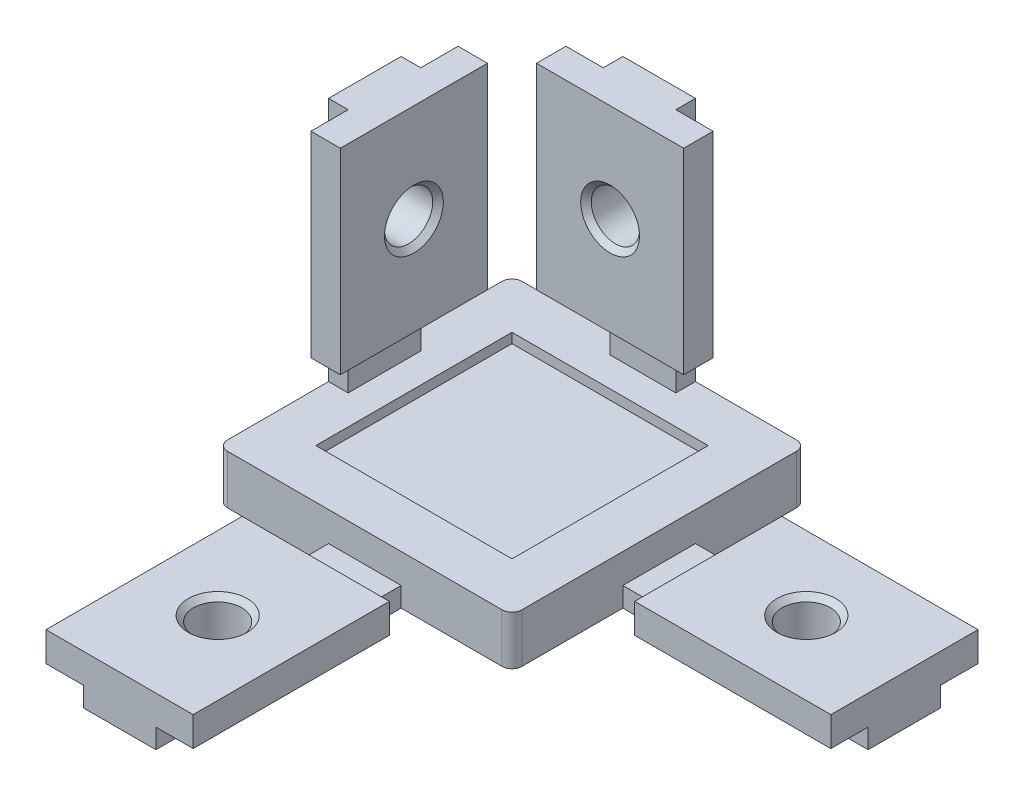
ISO-10303-21;
HEADER;
FILE_DESCRIPTION(('STEP AP214'),'2;1');
FILE_NAME('part.step','',(''),(''),'','','');
FILE_SCHEMA(('AUTOMOTIVE_DESIGN { 1 0 10303 214 1 1 1 1 }'));
ENDSEC;
DATA;
#1=APPLICATION_CONTEXT('core data for automotive mechanical design processes');
#2=APPLICATION_PROTOCOL_DEFINITION('international standard','automotive_design',2000,#1);
#3=PRODUCT_CONTEXT('',#1,'mechanical');
#4=PRODUCT('Part','Part','',(#3));
#5=PRODUCT_RELATED_PRODUCT_CATEGORY('part','',(#4));
#6=PRODUCT_DEFINITION_FORMATION('','',#4);
#7=PRODUCT_DEFINITION_CONTEXT('part definition',#1,'design');
#8=PRODUCT_DEFINITION('design','',#6,#7);
#9=PRODUCT_DEFINITION_SHAPE('','',#8);
#10=(LENGTH_UNIT() NAMED_UNIT(*) SI_UNIT(.MILLI.,.METRE.));
#11=(NAMED_UNIT(*) PLANE_ANGLE_UNIT() SI_UNIT($,.RADIAN.));
#12=(NAMED_UNIT(*) SI_UNIT($,.STERADIAN.) SOLID_ANGLE_UNIT());
#13=UNCERTAINTY_MEASURE_WITH_UNIT(LENGTH_MEASURE(1.E-05),#10,'distance_accuracy_value','');
#14=(GEOMETRIC_REPRESENTATION_CONTEXT(3) GLOBAL_UNCERTAINTY_ASSIGNED_CONTEXT((#13)) GLOBAL_UNIT_ASSIGNED_CONTEXT((#10,
#11,#12)) REPRESENTATION_CONTEXT('',''));
#15=CARTESIAN_POINT('',(0.,0.,0.));
#16=DIRECTION('',(0.,0.,1.));
#17=DIRECTION('',(1.,0.,0.));
#18=AXIS2_PLACEMENT_3D('',#15,#16,#17);
#19=CARTESIAN_POINT('',(40.,2.,11.3));
#20=DIRECTION('',(0.,-1.,0.));
#21=DIRECTION('',(0.,0.,-1.));
#22=AXIS2_PLACEMENT_3D('',#19,#20,#21);
#23=PLANE('',#22);
#24=DIRECTION('',(0.,0.,-1.));
#25=VECTOR('',#24,1.);
#26=CARTESIAN_POINT('',(20.,2.,18.7));
#27=LINE('',#26,#25);
#28=CARTESIAN_POINT('',(20.,2.,18.7));
#29=VERTEX_POINT('',#28);
#30=CARTESIAN_POINT('',(20.,2.,11.3));
#31=VERTEX_POINT('',#30);
#32=EDGE_CURVE('E7',#29,#31,#27,.T.);
#33=ORIENTED_EDGE('',*,*,#32,.T.);
#34=DIRECTION('',(-1.,0.,0.));
#35=VECTOR('',#34,1.);
#36=CARTESIAN_POINT('',(20.,2.,11.3));
#37=LINE('',#36,#35);
#38=CARTESIAN_POINT('',(15.,2.,11.3));
#39=VERTEX_POINT('',#38);
#40=EDGE_CURVE('E14',#31,#39,#37,.T.);
#41=ORIENTED_EDGE('',*,*,#40,.T.);
#42=DIRECTION('',(0.,0.,1.));
#43=VECTOR('',#42,1.);
#44=CARTESIAN_POINT('',(15.,2.,11.3));
#45=LINE('',#44,#43);
#46=CARTESIAN_POINT('',(15.,2.,18.7));
#47=VERTEX_POINT('',#46);
#48=EDGE_CURVE('E21',#39,#47,#45,.T.);
#49=ORIENTED_EDGE('',*,*,#48,.T.);
#50=DIRECTION('',(-1.,0.,0.));
#51=VECTOR('',#50,1.);
#52=CARTESIAN_POINT('',(20.,2.,18.7));
#53=LINE('',#52,#51);
#54=EDGE_CURVE('E28',#29,#47,#53,.T.);
#55=ORIENTED_EDGE('',*,*,#54,.F.);
#56=EDGE_LOOP('',(#33,#41,#49,#55));
#57=FACE_BOUND('',#56,.T.);
#58=ADVANCED_FACE('F34',(#57),#23,.F.);
#59=CARTESIAN_POINT('',(15.,5.,29.));
#60=DIRECTION('',(-1.,0.,0.));
#61=DIRECTION('',(0.,0.,1.));
#62=AXIS2_PLACEMENT_3D('',#59,#60,#61);
#63=PLANE('',#62);
#64=DIRECTION('',(0.,-1.,0.));
#65=VECTOR('',#64,1.);
#66=CARTESIAN_POINT('',(15.,2.,18.7));
#67=LINE('',#66,#65);
#68=CARTESIAN_POINT('',(15.,0.,18.7));
#69=VERTEX_POINT('',#68);
#70=EDGE_CURVE('E47',#47,#69,#67,.T.);
#71=ORIENTED_EDGE('',*,*,#70,.F.);
#72=ORIENTED_EDGE('',*,*,#48,.F.);
#73=DIRECTION('',(0.,1.,0.));
#74=VECTOR('',#73,1.);
#75=CARTESIAN_POINT('',(15.,0.,11.3));
#76=LINE('',#75,#74);
#77=CARTESIAN_POINT('',(15.,0.,11.3));
#78=VERTEX_POINT('',#77);
#79=EDGE_CURVE('E53',#78,#39,#76,.T.);
#80=ORIENTED_EDGE('',*,*,#79,.F.);
#81=DIRECTION('',(0.,0.,-1.));
#82=VECTOR('',#81,1.);
#83=CARTESIAN_POINT('',(15.,0.,11.3));
#84=LINE('',#83,#82);
#85=CARTESIAN_POINT('',(15.,0.,1.));
#86=VERTEX_POINT('',#85);
#87=EDGE_CURVE('E60',#78,#86,#84,.T.);
#88=ORIENTED_EDGE('',*,*,#87,.T.);
#89=DIRECTION('',(0.,-1.,0.));
#90=VECTOR('',#89,1.);
#91=CARTESIAN_POINT('',(15.,5.,1.));
#92=LINE('',#91,#90);
#93=CARTESIAN_POINT('',(15.,5.,1.));
#94=VERTEX_POINT('',#93);
#95=EDGE_CURVE('E67',#94,#86,#92,.T.);
#96=ORIENTED_EDGE('',*,*,#95,.F.);
#97=DIRECTION('',(0.,0.,-1.));
#98=VECTOR('',#97,1.);
#99=CARTESIAN_POINT('',(15.,5.,29.));
#100=LINE('',#99,#98);
#101=CARTESIAN_POINT('',(15.,5.,29.));
#102=VERTEX_POINT('',#101);
#103=EDGE_CURVE('E74',#102,#94,#100,.T.);
#104=ORIENTED_EDGE('',*,*,#103,.F.);
#105=DIRECTION('',(0.,-1.,0.));
#106=VECTOR('',#105,1.);
#107=CARTESIAN_POINT('',(15.,5.,29.));
#108=LINE('',#107,#106);
#109=CARTESIAN_POINT('',(15.,0.,29.));
#110=VERTEX_POINT('',#109);
#111=EDGE_CURVE('E81',#102,#110,#108,.T.);
#112=ORIENTED_EDGE('',*,*,#111,.T.);
#113=DIRECTION('',(0.,0.,-1.));
#114=VECTOR('',#113,1.);
#115=CARTESIAN_POINT('',(15.,0.,29.));
#116=LINE('',#115,#114);
#117=EDGE_CURVE('E88',#110,#69,#116,.T.);
#118=ORIENTED_EDGE('',*,*,#117,.T.);
#119=EDGE_LOOP('',(#71,#72,#80,#88,#96,#104,#112,#118));
#120=FACE_BOUND('',#119,.T.);
#121=ADVANCED_FACE('F94',(#120),#63,.F.);
#122=CARTESIAN_POINT('',(-3.7,30.,2.));
#123=DIRECTION('',(0.,0.,-1.));
#124=DIRECTION('',(-1.,0.,0.));
#125=AXIS2_PLACEMENT_3D('',#122,#123,#124);
#126=PLANE('',#125);
#127=DIRECTION('',(0.,1.,0.));
#128=VECTOR('',#127,1.);
#129=CARTESIAN_POINT('',(-3.,5.,2.));
#130=LINE('',#129,#128);
#131=CARTESIAN_POINT('',(-3.,5.,2.));
#132=VERTEX_POINT('',#131);
#133=CARTESIAN_POINT('',(-3.,7.,2.));
#134=VERTEX_POINT('',#133);
#135=EDGE_CURVE('E103',#132,#134,#130,.T.);
#136=ORIENTED_EDGE('',*,*,#135,.F.);
#137=DIRECTION('',(1.,0.,0.));
#138=VECTOR('',#137,1.);
#139=CARTESIAN_POINT('',(-3.,5.,2.));
#140=LINE('',#139,#138);
#141=CARTESIAN_POINT('',(3.7,5.,2.));
#142=VERTEX_POINT('',#141);
#143=EDGE_CURVE('E110',#132,#142,#140,.T.);
#144=ORIENTED_EDGE('',*,*,#143,.T.);
#145=DIRECTION('',(0.,-1.,0.));
#146=VECTOR('',#145,1.);
#147=CARTESIAN_POINT('',(3.7,10.,2.));
#148=LINE('',#147,#146);
#149=CARTESIAN_POINT('',(3.7,10.,2.));
#150=VERTEX_POINT('',#149);
#151=EDGE_CURVE('E117',#150,#142,#148,.T.);
#152=ORIENTED_EDGE('',*,*,#151,.F.);
#153=DIRECTION('',(-1.,0.,0.));
#154=VECTOR('',#153,1.);
#155=CARTESIAN_POINT('',(3.7,10.,2.));
#156=LINE('',#155,#154);
#157=CARTESIAN_POINT('',(-3.7,10.,2.));
#158=VERTEX_POINT('',#157);
#159=EDGE_CURVE('E124',#150,#158,#156,.T.);
#160=ORIENTED_EDGE('',*,*,#159,.T.);
#161=DIRECTION('',(0.,-1.,0.));
#162=VECTOR('',#161,1.);
#163=CARTESIAN_POINT('',(-3.7,10.,2.));
#164=LINE('',#163,#162);
#165=CARTESIAN_POINT('',(-3.7,7.,2.));
#166=VERTEX_POINT('',#165);
#167=EDGE_CURVE('E131',#158,#166,#164,.T.);
#168=ORIENTED_EDGE('',*,*,#167,.T.);
#169=DIRECTION('',(1.,0.,0.));
#170=VECTOR('',#169,1.);
#171=CARTESIAN_POINT('',(-3.7,7.,2.));
#172=LINE('',#171,#170);
#173=EDGE_CURVE('E138',#166,#134,#172,.T.);
#174=ORIENTED_EDGE('',*,*,#173,.T.);
#175=EDGE_LOOP('',(#136,#144,#152,#160,#168,#174));
#176=FACE_BOUND('',#175,.T.);
#177=ADVANCED_FACE('F144',(#176),#126,.F.);
#178=CARTESIAN_POINT('',(-13.,30.,18.7));
#179=DIRECTION('',(-1.,0.,0.));
#180=DIRECTION('',(0.,0.,1.));
#181=AXIS2_PLACEMENT_3D('',#178,#179,#180);
#182=PLANE('',#181);
#183=DIRECTION('',(0.,-1.,0.));
#184=VECTOR('',#183,1.);
#185=CARTESIAN_POINT('',(-13.,10.,18.7));
#186=LINE('',#185,#184);
#187=CARTESIAN_POINT('',(-13.,10.,18.7));
#188=VERTEX_POINT('',#187);
#189=CARTESIAN_POINT('',(-13.,5.,18.7));
#190=VERTEX_POINT('',#189);
#191=EDGE_CURVE('E153',#188,#190,#186,.T.);
#192=ORIENTED_EDGE('',*,*,#191,.T.);
#193=DIRECTION('',(0.,0.,1.));
#194=VECTOR('',#193,1.);
#195=CARTESIAN_POINT('',(-13.,5.,11.3));
#196=LINE('',#195,#194);
#197=CARTESIAN_POINT('',(-13.,5.,11.3));
#198=VERTEX_POINT('',#197);
#199=EDGE_CURVE('E160',#198,#190,#196,.T.);
#200=ORIENTED_EDGE('',*,*,#199,.F.);
#201=DIRECTION('',(0.,-1.,0.));
#202=VECTOR('',#201,1.);
#203=CARTESIAN_POINT('',(-13.,10.,11.3));
#204=LINE('',#203,#202);
#205=CARTESIAN_POINT('',(-13.,10.,11.3));
#206=VERTEX_POINT('',#205);
#207=EDGE_CURVE('E167',#206,#198,#204,.T.);
#208=ORIENTED_EDGE('',*,*,#207,.F.);
#209=DIRECTION('',(0.,0.,1.));
#210=VECTOR('',#209,1.);
#211=CARTESIAN_POINT('',(-13.,10.,11.3));
#212=LINE('',#211,#210);
#213=EDGE_CURVE('E174',#206,#188,#212,.T.);
#214=ORIENTED_EDGE('',*,*,#213,.T.);
#215=EDGE_LOOP('',(#192,#200,#208,#214));
#216=FACE_BOUND('',#215,.T.);
#217=ADVANCED_FACE('F180',(#216),#182,.F.);
#218=CARTESIAN_POINT('',(-14.0000000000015,5.,29.0000000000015));
#219=DIRECTION('',(0.,1.,0.));
#220=DIRECTION('',(0.,0.,1.));
#221=AXIS2_PLACEMENT_3D('',#218,#219,#220);
#222=PLANE('',#221);
#223=ORIENTED_EDGE('',*,*,#199,.T.);
#224=DIRECTION('',(-1.,0.,0.));
#225=VECTOR('',#224,1.);
#226=CARTESIAN_POINT('',(-13.,5.,18.7));
#227=LINE('',#226,#225);
#228=CARTESIAN_POINT('',(-15.,5.,18.7));
#229=VERTEX_POINT('',#228);
#230=EDGE_CURVE('E190',#190,#229,#227,.T.);
#231=ORIENTED_EDGE('',*,*,#230,.T.);
#232=DIRECTION('',(0.,0.,1.));
#233=VECTOR('',#232,1.);
#234=CARTESIAN_POINT('',(-15.,5.,18.7));
#235=LINE('',#234,#233);
#236=CARTESIAN_POINT('',(-15.,5.,29.));
#237=VERTEX_POINT('',#236);
#238=EDGE_CURVE('E197',#229,#237,#235,.T.);
#239=ORIENTED_EDGE('',*,*,#238,.T.);
#240=CARTESIAN_POINT('',(-14.0000000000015,5.,29.0000000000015));
#241=DIRECTION('',(0.,1.,0.));
#242=DIRECTION('',(-1.,0.,-1.54898316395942E-12));
#243=AXIS2_PLACEMENT_3D('',#240,#241,#242);
#244=CIRCLE('',#243,0.999999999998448);
#245=CARTESIAN_POINT('',(-14.,5.,30.));
#246=VERTEX_POINT('',#245);
#247=EDGE_CURVE('E204',#237,#246,#244,.T.);
#248=ORIENTED_EDGE('',*,*,#247,.T.);
#249=DIRECTION('',(1.,0.,0.));
#250=VECTOR('',#249,1.);
#251=CARTESIAN_POINT('',(-14.,5.,30.));
#252=LINE('',#251,#250);
#253=CARTESIAN_POINT('',(14.,5.,30.));
#254=VERTEX_POINT('',#253);
#255=EDGE_CURVE('E211',#246,#254,#252,.T.);
#256=ORIENTED_EDGE('',*,*,#255,.T.);
#257=CARTESIAN_POINT('',(14.0000000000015,5.,29.0000000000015));
#258=DIRECTION('',(0.,1.,0.));
#259=DIRECTION('',(-1.5401013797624E-12,0.,1.));
#260=AXIS2_PLACEMENT_3D('',#257,#258,#259);
#261=CIRCLE('',#260,0.99999999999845);
#262=EDGE_CURVE('E218',#254,#102,#261,.T.);
#263=ORIENTED_EDGE('',*,*,#262,.T.);
#264=ORIENTED_EDGE('',*,*,#103,.T.);
#265=CARTESIAN_POINT('',(14.0000000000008,5.,0.99999999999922));
#266=DIRECTION('',(0.,1.,0.));
#267=DIRECTION('',(1.,0.,0.));
#268=AXIS2_PLACEMENT_3D('',#265,#266,#267);
#269=CIRCLE('',#268,0.999999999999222);
#270=CARTESIAN_POINT('',(14.,5.,0.));
#271=VERTEX_POINT('',#270);
#272=EDGE_CURVE('E224',#94,#271,#269,.T.);
#273=ORIENTED_EDGE('',*,*,#272,.T.);
#274=DIRECTION('',(-1.,0.,0.));
#275=VECTOR('',#274,1.);
#276=CARTESIAN_POINT('',(14.,5.,0.));
#277=LINE('',#276,#275);
#278=CARTESIAN_POINT('',(3.7,5.,0.));
#279=VERTEX_POINT('',#278);
#280=EDGE_CURVE('E231',#271,#279,#277,.T.);
#281=ORIENTED_EDGE('',*,*,#280,.T.);
#282=DIRECTION('',(0.,0.,-1.));
#283=VECTOR('',#282,1.);
#284=CARTESIAN_POINT('',(3.7,5.,2.));
#285=LINE('',#284,#283);
#286=EDGE_CURVE('E238',#142,#279,#285,.T.);
#287=ORIENTED_EDGE('',*,*,#286,.F.);
#288=ORIENTED_EDGE('',*,*,#143,.F.);
#289=DIRECTION('',(0.,0.,-1.));
#290=VECTOR('',#289,1.);
#291=CARTESIAN_POINT('',(-3.,5.,2.));
#292=LINE('',#291,#290);
#293=CARTESIAN_POINT('',(-3.,5.,0.));
#294=VERTEX_POINT('',#293);
#295=EDGE_CURVE('E244',#132,#294,#292,.T.);
#296=ORIENTED_EDGE('',*,*,#295,.T.);
#297=DIRECTION('',(-1.,0.,0.));
#298=VECTOR('',#297,1.);
#299=CARTESIAN_POINT('',(-3.,5.,0.));
#300=LINE('',#299,#298);
#301=CARTESIAN_POINT('',(-14.,5.,0.));
#302=VERTEX_POINT('',#301);
#303=EDGE_CURVE('E251',#294,#302,#300,.T.);
#304=ORIENTED_EDGE('',*,*,#303,.T.);
#305=CARTESIAN_POINT('',(-14.0000000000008,5.,0.99999999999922));
#306=DIRECTION('',(0.,1.,0.));
#307=DIRECTION('',(7.79820652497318E-13,0.,-1.));
#308=AXIS2_PLACEMENT_3D('',#305,#306,#307);
#309=CIRCLE('',#308,0.99999999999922);
#310=CARTESIAN_POINT('',(-15.,5.,1.));
#311=VERTEX_POINT('',#310);
#312=EDGE_CURVE('E258',#302,#311,#309,.T.);
#313=ORIENTED_EDGE('',*,*,#312,.T.);
#314=DIRECTION('',(0.,0.,1.));
#315=VECTOR('',#314,1.);
#316=CARTESIAN_POINT('',(-15.,5.,1.));
#317=LINE('',#316,#315);
#318=CARTESIAN_POINT('',(-15.,5.,11.3));
#319=VERTEX_POINT('',#318);
#320=EDGE_CURVE('E265',#311,#319,#317,.T.);
#321=ORIENTED_EDGE('',*,*,#320,.T.);
#322=DIRECTION('',(1.,0.,0.));
#323=VECTOR('',#322,1.);
#324=CARTESIAN_POINT('',(-15.,5.,11.3));
#325=LINE('',#324,#323);
#326=EDGE_CURVE('E272',#319,#198,#325,.T.);
#327=ORIENTED_EDGE('',*,*,#326,.T.);
#328=EDGE_LOOP('',(#223,#231,#239,#248,#256,#263,#264,#273,#281,#287,#288,#296,#304,#313,#321,#327));
#329=FACE_BOUND('',#328,.T.);
#330=DIRECTION('',(0.,0.,1.));
#331=VECTOR('',#330,1.);
#332=CARTESIAN_POINT('',(-10.,5.,5.));
#333=LINE('',#332,#331);
#334=CARTESIAN_POINT('',(-10.,5.,5.));
#335=VERTEX_POINT('',#334);
#336=CARTESIAN_POINT('',(-10.,5.,25.));
#337=VERTEX_POINT('',#336);
#338=EDGE_CURVE('E278',#335,#337,#333,.T.);
#339=ORIENTED_EDGE('',*,*,#338,.F.);
#340=DIRECTION('',(-1.,0.,0.));
#341=VECTOR('',#340,1.);
#342=CARTESIAN_POINT('',(10.,5.,5.));
#343=LINE('',#342,#341);
#344=CARTESIAN_POINT('',(10.,5.,5.));
#345=VERTEX_POINT('',#344);
#346=EDGE_CURVE('E285',#345,#335,#343,.T.);
#347=ORIENTED_EDGE('',*,*,#346,.F.);
#348=DIRECTION('',(0.,0.,-1.));
#349=VECTOR('',#348,1.);
#350=CARTESIAN_POINT('',(10.,5.,25.));
#351=LINE('',#350,#349);
#352=CARTESIAN_POINT('',(10.,5.,25.));
#353=VERTEX_POINT('',#352);
#354=EDGE_CURVE('E292',#353,#345,#351,.T.);
#355=ORIENTED_EDGE('',*,*,#354,.F.);
#356=DIRECTION('',(1.,0.,0.));
#357=VECTOR('',#356,1.);
#358=CARTESIAN_POINT('',(-10.,5.,25.));
#359=LINE('',#358,#357);
#360=EDGE_CURVE('E299',#337,#353,#359,.T.);
#361=ORIENTED_EDGE('',*,*,#360,.F.);
#362=EDGE_LOOP('',(#339,#347,#355,#361));
#363=FACE_BOUND('',#362,.T.);
#364=ADVANCED_FACE('F305',(#329,#363),#222,.T.);
#365=CARTESIAN_POINT('',(3.7,2.,55.));
#366=DIRECTION('',(0.,-1.,0.));
#367=DIRECTION('',(0.,0.,-1.));
#368=AXIS2_PLACEMENT_3D('',#365,#366,#367);
#369=PLANE('',#368);
#370=DIRECTION('',(1.,0.,0.));
#371=VECTOR('',#370,1.);
#372=CARTESIAN_POINT('',(-3.7,2.,30.));
#373=LINE('',#372,#371);
#374=CARTESIAN_POINT('',(-3.7,2.,30.));
#375=VERTEX_POINT('',#374);
#376=CARTESIAN_POINT('',(3.7,2.,30.));
#377=VERTEX_POINT('',#376);
#378=EDGE_CURVE('E314',#375,#377,#373,.T.);
#379=ORIENTED_EDGE('',*,*,#378,.F.);
#380=DIRECTION('',(0.,0.,-1.));
#381=VECTOR('',#380,1.);
#382=CARTESIAN_POINT('',(-3.7,2.,35.));
#383=LINE('',#382,#381);
#384=CARTESIAN_POINT('',(-3.7,2.,35.));
#385=VERTEX_POINT('',#384);
#386=EDGE_CURVE('E321',#385,#375,#383,.T.);
#387=ORIENTED_EDGE('',*,*,#386,.F.);
#388=DIRECTION('',(1.,0.,0.));
#389=VECTOR('',#388,1.);
#390=CARTESIAN_POINT('',(-3.7,2.,35.));
#391=LINE('',#390,#389);
#392=CARTESIAN_POINT('',(3.7,2.,35.));
#393=VERTEX_POINT('',#392);
#394=EDGE_CURVE('E328',#385,#393,#391,.T.);
#395=ORIENTED_EDGE('',*,*,#394,.T.);
#396=DIRECTION('',(0.,0.,-1.));
#397=VECTOR('',#396,1.);
#398=CARTESIAN_POINT('',(3.7,2.,35.));
#399=LINE('',#398,#397);
#400=EDGE_CURVE('E335',#393,#377,#399,.T.);
#401=ORIENTED_EDGE('',*,*,#400,.T.);
#402=EDGE_LOOP('',(#379,#387,#395,#401));
#403=FACE_BOUND('',#402,.T.);
#404=ADVANCED_FACE('F341',(#403),#369,.F.);
#405=CARTESIAN_POINT('',(-3.7,2.,55.));
#406=DIRECTION('',(1.,0.,0.));
#407=DIRECTION('',(0.,0.,-1.));
#408=AXIS2_PLACEMENT_3D('',#405,#406,#407);
#409=PLANE('',#408);
#410=DIRECTION('',(0.,1.,0.));
#411=VECTOR('',#410,1.);
#412=CARTESIAN_POINT('',(-3.7,0.,30.));
#413=LINE('',#412,#411);
#414=CARTESIAN_POINT('',(-3.7,0.,30.));
#415=VERTEX_POINT('',#414);
#416=EDGE_CURVE('E350',#415,#375,#413,.T.);
#417=ORIENTED_EDGE('',*,*,#416,.F.);
#418=DIRECTION('',(0.,0.,-1.));
#419=VECTOR('',#418,1.);
#420=CARTESIAN_POINT('',(-3.7,0.,55.));
#421=LINE('',#420,#419);
#422=CARTESIAN_POINT('',(-3.7,0.,55.));
#423=VERTEX_POINT('',#422);
#424=EDGE_CURVE('E357',#423,#415,#421,.T.);
#425=ORIENTED_EDGE('',*,*,#424,.F.);
#426=DIRECTION('',(0.,-1.,0.));
#427=VECTOR('',#426,1.);
#428=CARTESIAN_POINT('',(-3.7,2.,55.));
#429=LINE('',#428,#427);
#430=CARTESIAN_POINT('',(-3.7,2.,55.));
#431=VERTEX_POINT('',#430);
#432=EDGE_CURVE('E364',#431,#423,#429,.T.);
#433=ORIENTED_EDGE('',*,*,#432,.F.);
#434=DIRECTION('',(0.,0.,-1.));
#435=VECTOR('',#434,1.);
#436=CARTESIAN_POINT('',(-3.7,2.,55.));
#437=LINE('',#436,#435);
#438=EDGE_CURVE('E371',#431,#385,#437,.T.);
#439=ORIENTED_EDGE('',*,*,#438,.T.);
#440=ORIENTED_EDGE('',*,*,#386,.T.);
#441=EDGE_LOOP('',(#417,#425,#433,#439,#440));
#442=FACE_BOUND('',#441,.T.);
#443=ADVANCED_FACE('F376',(#442),#409,.F.);
#444=CARTESIAN_POINT('',(3.7,0.,55.));
#445=DIRECTION('',(-1.,0.,0.));
#446=DIRECTION('',(0.,0.,1.));
#447=AXIS2_PLACEMENT_3D('',#444,#445,#446);
#448=PLANE('',#447);
#449=DIRECTION('',(0.,-1.,0.));
#450=VECTOR('',#449,1.);
#451=CARTESIAN_POINT('',(3.7,2.,30.));
#452=LINE('',#451,#450);
#453=CARTESIAN_POINT('',(3.7,0.,30.));
#454=VERTEX_POINT('',#453);
#455=EDGE_CURVE('E385',#377,#454,#452,.T.);
#456=ORIENTED_EDGE('',*,*,#455,.F.);
#457=ORIENTED_EDGE('',*,*,#400,.F.);
#458=DIRECTION('',(0.,0.,-1.));
#459=VECTOR('',#458,1.);
#460=CARTESIAN_POINT('',(3.7,2.,55.));
#461=LINE('',#460,#459);
#462=CARTESIAN_POINT('',(3.7,2.,55.));
#463=VERTEX_POINT('',#462);
#464=EDGE_CURVE('E391',#463,#393,#461,.T.);
#465=ORIENTED_EDGE('',*,*,#464,.F.);
#466=DIRECTION('',(0.,1.,0.));
#467=VECTOR('',#466,1.);
#468=CARTESIAN_POINT('',(3.7,0.,55.));
#469=LINE('',#468,#467);
#470=CARTESIAN_POINT('',(3.7,0.,55.));
#471=VERTEX_POINT('',#470);
#472=EDGE_CURVE('E398',#471,#463,#469,.T.);
#473=ORIENTED_EDGE('',*,*,#472,.F.);
#474=DIRECTION('',(0.,0.,-1.));
#475=VECTOR('',#474,1.);
#476=CARTESIAN_POINT('',(3.7,0.,55.));
#477=LINE('',#476,#475);
#478=EDGE_CURVE('E405',#471,#454,#477,.T.);
#479=ORIENTED_EDGE('',*,*,#478,.T.);
#480=EDGE_LOOP('',(#456,#457,#465,#473,#479));
#481=FACE_BOUND('',#480,.T.);
#482=ADVANCED_FACE('F411',(#481),#448,.F.);
#483=DIRECTION('',(0.,-1.,0.));
#484=VECTOR('',#483,1.);
#485=CARTESIAN_POINT('',(-3.7,30.,0.));
#486=LINE('',#485,#484);
#487=CARTESIAN_POINT('',(-3.7,30.,0.));
#488=VERTEX_POINT('',#487);
#489=CARTESIAN_POINT('',(-3.7,7.,0.));
#490=VERTEX_POINT('',#489);
#491=EDGE_CURVE('E420',#488,#490,#486,.T.);
#492=ORIENTED_EDGE('',*,*,#491,.T.);
#493=DIRECTION('',(0.,0.,1.));
#494=VECTOR('',#493,1.);
#495=CARTESIAN_POINT('',(-3.7,7.,0.));
#496=LINE('',#495,#494);
#497=EDGE_CURVE('E427',#490,#166,#496,.T.);
#498=ORIENTED_EDGE('',*,*,#497,.T.);
#499=ORIENTED_EDGE('',*,*,#167,.F.);
#500=DIRECTION('',(0.,-1.,0.));
#501=VECTOR('',#500,1.);
#502=CARTESIAN_POINT('',(-3.7,30.,2.));
#503=LINE('',#502,#501);
#504=CARTESIAN_POINT('',(-3.7,30.,2.));
#505=VERTEX_POINT('',#504);
#506=EDGE_CURVE('E433',#505,#158,#503,.T.);
#507=ORIENTED_EDGE('',*,*,#506,.F.);
#508=DIRECTION('',(0.,0.,1.));
#509=VECTOR('',#508,1.);
#510=CARTESIAN_POINT('',(-3.7,30.,0.));
#511=LINE('',#510,#509);
#512=EDGE_CURVE('E440',#488,#505,#511,.T.);
#513=ORIENTED_EDGE('',*,*,#512,.F.);
#514=EDGE_LOOP('',(#492,#498,#499,#507,#513));
#515=FACE_BOUND('',#514,.T.);
#516=ADVANCED_FACE('F445',(#515),#409,.F.);
#517=CARTESIAN_POINT('',(-3.7,0.,55.));
#518=DIRECTION('',(0.,1.,0.));
#519=DIRECTION('',(0.,0.,1.));
#520=AXIS2_PLACEMENT_3D('',#517,#518,#519);
#521=PLANE('',#520);
#522=CARTESIAN_POINT('',(30.,0.,15.));
#523=DIRECTION('',(0.,-1.,0.));
#524=DIRECTION('',(0.,0.,-1.));
#525=AXIS2_PLACEMENT_3D('',#522,#523,#524);
#526=CIRCLE('',#525,3.);
#527=CARTESIAN_POINT('',(30.,0.,12.));
#528=VERTEX_POINT('',#527);
#529=EDGE_CURVE('E452',#528,#528,#526,.T.);
#530=ORIENTED_EDGE('',*,*,#529,.F.);
#531=EDGE_LOOP('',(#530));
#532=FACE_BOUND('',#531,.T.);
#533=CARTESIAN_POINT('',(0.,0.,45.));
#534=DIRECTION('',(0.,-1.,0.));
#535=DIRECTION('',(0.,0.,-1.));
#536=AXIS2_PLACEMENT_3D('',#533,#534,#535);
#537=CIRCLE('',#536,3.);
#538=CARTESIAN_POINT('',(0.,0.,42.));
#539=VERTEX_POINT('',#538);
#540=EDGE_CURVE('E456',#539,#539,#537,.T.);
#541=ORIENTED_EDGE('',*,*,#540,.F.);
#542=EDGE_LOOP('',(#541));
#543=FACE_BOUND('',#542,.T.);
#544=ORIENTED_EDGE('',*,*,#87,.F.);
#545=DIRECTION('',(-1.,0.,0.));
#546=VECTOR('',#545,1.);
#547=CARTESIAN_POINT('',(40.,0.,11.3));
#548=LINE('',#547,#546);
#549=CARTESIAN_POINT('',(40.,0.,11.3));
#550=VERTEX_POINT('',#549);
#551=EDGE_CURVE('E463',#550,#78,#548,.T.);
#552=ORIENTED_EDGE('',*,*,#551,.F.);
#553=DIRECTION('',(0.,0.,-1.));
#554=VECTOR('',#553,1.);
#555=CARTESIAN_POINT('',(40.,0.,18.7));
#556=LINE('',#555,#554);
#557=CARTESIAN_POINT('',(40.,0.,18.7));
#558=VERTEX_POINT('',#557);
#559=EDGE_CURVE('E470',#558,#550,#556,.T.);
#560=ORIENTED_EDGE('',*,*,#559,.F.);
#561=DIRECTION('',(-1.,0.,0.));
#562=VECTOR('',#561,1.);
#563=CARTESIAN_POINT('',(40.,0.,18.7));
#564=LINE('',#563,#562);
#565=EDGE_CURVE('E477',#558,#69,#564,.T.);
#566=ORIENTED_EDGE('',*,*,#565,.T.);
#567=ORIENTED_EDGE('',*,*,#117,.F.);
#568=CARTESIAN_POINT('',(14.0000000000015,0.,29.0000000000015));
#569=DIRECTION('',(0.,1.,0.));
#570=DIRECTION('',(-1.5401013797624E-12,0.,1.));
#571=AXIS2_PLACEMENT_3D('',#568,#569,#570);
#572=CIRCLE('',#571,0.99999999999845);
#573=CARTESIAN_POINT('',(14.,0.,30.));
#574=VERTEX_POINT('',#573);
#575=EDGE_CURVE('E483',#574,#110,#572,.T.);
#576=ORIENTED_EDGE('',*,*,#575,.F.);
#577=DIRECTION('',(1.,0.,0.));
#578=VECTOR('',#577,1.);
#579=CARTESIAN_POINT('',(3.7,0.,30.));
#580=LINE('',#579,#578);
#581=EDGE_CURVE('E490',#454,#574,#580,.T.);
#582=ORIENTED_EDGE('',*,*,#581,.F.);
#583=ORIENTED_EDGE('',*,*,#478,.F.);
#584=DIRECTION('',(1.,0.,0.));
#585=VECTOR('',#584,1.);
#586=CARTESIAN_POINT('',(-3.7,0.,55.));
#587=LINE('',#586,#585);
#588=EDGE_CURVE('E496',#423,#471,#587,.T.);
#589=ORIENTED_EDGE('',*,*,#588,.F.);
#590=ORIENTED_EDGE('',*,*,#424,.T.);
#591=DIRECTION('',(1.,0.,0.));
#592=VECTOR('',#591,1.);
#593=CARTESIAN_POINT('',(-14.,0.,30.));
#594=LINE('',#593,#592);
#595=CARTESIAN_POINT('',(-14.,0.,30.));
#596=VERTEX_POINT('',#595);
#597=EDGE_CURVE('E502',#596,#415,#594,.T.);
#598=ORIENTED_EDGE('',*,*,#597,.F.);
#599=CARTESIAN_POINT('',(-14.0000000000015,0.,29.0000000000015));
#600=DIRECTION('',(0.,1.,0.));
#601=DIRECTION('',(-1.,0.,-1.54898316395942E-12));
#602=AXIS2_PLACEMENT_3D('',#599,#600,#601);
#603=CIRCLE('',#602,0.999999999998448);
#604=CARTESIAN_POINT('',(-15.,0.,29.));
#605=VERTEX_POINT('',#604);
#606=EDGE_CURVE('E509',#605,#596,#603,.T.);
#607=ORIENTED_EDGE('',*,*,#606,.F.);
#608=DIRECTION('',(0.,0.,1.));
#609=VECTOR('',#608,1.);
#610=CARTESIAN_POINT('',(-15.,0.,1.));
#611=LINE('',#610,#609);
#612=CARTESIAN_POINT('',(-15.,0.,1.));
#613=VERTEX_POINT('',#612);
#614=EDGE_CURVE('E516',#613,#605,#611,.T.);
#615=ORIENTED_EDGE('',*,*,#614,.F.);
#616=CARTESIAN_POINT('',(-14.0000000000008,0.,0.99999999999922));
#617=DIRECTION('',(0.,1.,0.));
#618=DIRECTION('',(7.79820652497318E-13,0.,-1.));
#619=AXIS2_PLACEMENT_3D('',#616,#617,#618);
#620=CIRCLE('',#619,0.99999999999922);
#621=CARTESIAN_POINT('',(-14.,0.,0.));
#622=VERTEX_POINT('',#621);
#623=EDGE_CURVE('E523',#622,#613,#620,.T.);
#624=ORIENTED_EDGE('',*,*,#623,.F.);
#625=DIRECTION('',(1.,0.,0.));
#626=VECTOR('',#625,1.);
#627=CARTESIAN_POINT('',(-14.,0.,0.));
#628=LINE('',#627,#626);
#629=CARTESIAN_POINT('',(14.,0.,0.));
#630=VERTEX_POINT('',#629);
#631=EDGE_CURVE('E530',#622,#630,#628,.T.);
#632=ORIENTED_EDGE('',*,*,#631,.T.);
#633=CARTESIAN_POINT('',(14.0000000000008,0.,0.99999999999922));
#634=DIRECTION('',(0.,1.,0.));
#635=DIRECTION('',(1.,0.,0.));
#636=AXIS2_PLACEMENT_3D('',#633,#634,#635);
#637=CIRCLE('',#636,0.999999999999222);
#638=EDGE_CURVE('E537',#86,#630,#637,.T.);
#639=ORIENTED_EDGE('',*,*,#638,.F.);
#640=EDGE_LOOP('',(#544,#552,#560,#566,#567,#576,#582,#583,#589,#590,#598,#607,#615,#624,#632,#639));
#641=FACE_BOUND('',#640,.T.);
#642=ADVANCED_FACE('F541',(#532,#543,#641),#521,.F.);
#643=ORIENTED_EDGE('',*,*,#151,.T.);
#644=ORIENTED_EDGE('',*,*,#286,.T.);
#645=DIRECTION('',(0.,1.,0.));
#646=VECTOR('',#645,1.);
#647=CARTESIAN_POINT('',(3.7,5.,0.));
#648=LINE('',#647,#646);
#649=CARTESIAN_POINT('',(3.7,30.,0.));
#650=VERTEX_POINT('',#649);
#651=EDGE_CURVE('E552',#279,#650,#648,.T.);
#652=ORIENTED_EDGE('',*,*,#651,.T.);
#653=DIRECTION('',(0.,0.,-1.));
#654=VECTOR('',#653,1.);
#655=CARTESIAN_POINT('',(3.7,30.,2.));
#656=LINE('',#655,#654);
#657=CARTESIAN_POINT('',(3.7,30.,2.));
#658=VERTEX_POINT('',#657);
#659=EDGE_CURVE('E559',#658,#650,#656,.T.);
#660=ORIENTED_EDGE('',*,*,#659,.F.);
#661=DIRECTION('',(0.,-1.,0.));
#662=VECTOR('',#661,1.);
#663=CARTESIAN_POINT('',(3.7,30.,2.));
#664=LINE('',#663,#662);
#665=EDGE_CURVE('E566',#658,#150,#664,.T.);
#666=ORIENTED_EDGE('',*,*,#665,.T.);
#667=EDGE_LOOP('',(#643,#644,#652,#660,#666));
#668=FACE_BOUND('',#667,.T.);
#669=ADVANCED_FACE('F569',(#668),#448,.F.);
#670=CARTESIAN_POINT('',(0.,0.,55.));
#671=DIRECTION('',(0.,0.,1.));
#672=DIRECTION('',(1.,0.,0.));
#673=AXIS2_PLACEMENT_3D('',#670,#671,#672);
#674=PLANE('',#673);
#675=ORIENTED_EDGE('',*,*,#472,.T.);
#676=DIRECTION('',(1.,0.,0.));
#677=VECTOR('',#676,1.);
#678=CARTESIAN_POINT('',(3.7,2.,55.));
#679=LINE('',#678,#677);
#680=CARTESIAN_POINT('',(7.5,2.,55.));
#681=VERTEX_POINT('',#680);
#682=EDGE_CURVE('E579',#463,#681,#679,.T.);
#683=ORIENTED_EDGE('',*,*,#682,.T.);
#684=DIRECTION('',(0.,1.,0.));
#685=VECTOR('',#684,1.);
#686=CARTESIAN_POINT('',(7.5,2.,55.));
#687=LINE('',#686,#685);
#688=CARTESIAN_POINT('',(7.5,5.,55.));
#689=VERTEX_POINT('',#688);
#690=EDGE_CURVE('E586',#681,#689,#687,.T.);
#691=ORIENTED_EDGE('',*,*,#690,.T.);
#692=DIRECTION('',(-1.,0.,0.));
#693=VECTOR('',#692,1.);
#694=CARTESIAN_POINT('',(7.5,5.,55.));
#695=LINE('',#694,#693);
#696=CARTESIAN_POINT('',(-7.5,5.,55.));
#697=VERTEX_POINT('',#696);
#698=EDGE_CURVE('E593',#689,#697,#695,.T.);
#699=ORIENTED_EDGE('',*,*,#698,.T.);
#700=DIRECTION('',(0.,-1.,0.));
#701=VECTOR('',#700,1.);
#702=CARTESIAN_POINT('',(-7.5,5.,55.));
#703=LINE('',#702,#701);
#704=CARTESIAN_POINT('',(-7.5,2.,55.));
#705=VERTEX_POINT('',#704);
#706=EDGE_CURVE('E600',#697,#705,#703,.T.);
#707=ORIENTED_EDGE('',*,*,#706,.T.);
#708=DIRECTION('',(1.,0.,0.));
#709=VECTOR('',#708,1.);
#710=CARTESIAN_POINT('',(-7.5,2.,55.));
#711=LINE('',#710,#709);
#712=EDGE_CURVE('E607',#705,#431,#711,.T.);
#713=ORIENTED_EDGE('',*,*,#712,.T.);
#714=ORIENTED_EDGE('',*,*,#432,.T.);
#715=ORIENTED_EDGE('',*,*,#588,.T.);
#716=EDGE_LOOP('',(#675,#683,#691,#699,#707,#713,#714,#715));
#717=FACE_BOUND('',#716,.T.);
#718=ADVANCED_FACE('F613',(#717),#674,.T.);
#719=CARTESIAN_POINT('',(0.,0.,0.));
#720=DIRECTION('',(0.,0.,1.));
#721=DIRECTION('',(1.,0.,0.));
#722=AXIS2_PLACEMENT_3D('',#719,#720,#721);
#723=PLANE('',#722);
#724=CARTESIAN_POINT('',(0.,20.,0.));
#725=DIRECTION('',(0.,0.,-1.));
#726=DIRECTION('',(-1.,0.,0.));
#727=AXIS2_PLACEMENT_3D('',#724,#725,#726);
#728=CIRCLE('',#727,3.);
#729=CARTESIAN_POINT('',(-3.,20.,0.));
#730=VERTEX_POINT('',#729);
#731=EDGE_CURVE('E620',#730,#730,#728,.T.);
#732=ORIENTED_EDGE('',*,*,#731,.F.);
#733=EDGE_LOOP('',(#732));
#734=FACE_BOUND('',#733,.T.);
#735=DIRECTION('',(0.,-1.,0.));
#736=VECTOR('',#735,1.);
#737=CARTESIAN_POINT('',(-3.,7.,0.));
#738=LINE('',#737,#736);
#739=CARTESIAN_POINT('',(-3.,7.,0.));
#740=VERTEX_POINT('',#739);
#741=EDGE_CURVE('E626',#740,#294,#738,.T.);
#742=ORIENTED_EDGE('',*,*,#741,.F.);
#743=DIRECTION('',(-1.,0.,0.));
#744=VECTOR('',#743,1.);
#745=CARTESIAN_POINT('',(-3.,7.,0.));
#746=LINE('',#745,#744);
#747=EDGE_CURVE('E633',#740,#490,#746,.T.);
#748=ORIENTED_EDGE('',*,*,#747,.T.);
#749=ORIENTED_EDGE('',*,*,#491,.F.);
#750=DIRECTION('',(-1.,0.,0.));
#751=VECTOR('',#750,1.);
#752=CARTESIAN_POINT('',(3.7,30.,0.));
#753=LINE('',#752,#751);
#754=EDGE_CURVE('E639',#650,#488,#753,.T.);
#755=ORIENTED_EDGE('',*,*,#754,.F.);
#756=ORIENTED_EDGE('',*,*,#651,.F.);
#757=ORIENTED_EDGE('',*,*,#280,.F.);
#758=DIRECTION('',(0.,-1.,0.));
#759=VECTOR('',#758,1.);
#760=CARTESIAN_POINT('',(14.,5.,0.));
#761=LINE('',#760,#759);
#762=EDGE_CURVE('E646',#271,#630,#761,.T.);
#763=ORIENTED_EDGE('',*,*,#762,.T.);
#764=ORIENTED_EDGE('',*,*,#631,.F.);
#765=DIRECTION('',(0.,-1.,0.));
#766=VECTOR('',#765,1.);
#767=CARTESIAN_POINT('',(-14.,5.,0.));
#768=LINE('',#767,#766);
#769=EDGE_CURVE('E652',#302,#622,#768,.T.);
#770=ORIENTED_EDGE('',*,*,#769,.F.);
#771=ORIENTED_EDGE('',*,*,#303,.F.);
#772=EDGE_LOOP('',(#742,#748,#749,#755,#756,#757,#763,#764,#770,#771));
#773=FACE_BOUND('',#772,.T.);
#774=ADVANCED_FACE('F657',(#734,#773),#723,.F.);
#775=CARTESIAN_POINT('',(-7.5,2.,35.));
#776=DIRECTION('',(0.,-1.,0.));
#777=DIRECTION('',(0.,0.,-1.));
#778=AXIS2_PLACEMENT_3D('',#775,#776,#777);
#779=PLANE('',#778);
#780=ORIENTED_EDGE('',*,*,#438,.F.);
#781=ORIENTED_EDGE('',*,*,#712,.F.);
#782=DIRECTION('',(0.,0.,1.));
#783=VECTOR('',#782,1.);
#784=CARTESIAN_POINT('',(-7.5,2.,35.));
#785=LINE('',#784,#783);
#786=CARTESIAN_POINT('',(-7.5,2.,35.));
#787=VERTEX_POINT('',#786);
#788=EDGE_CURVE('E668',#787,#705,#785,.T.);
#789=ORIENTED_EDGE('',*,*,#788,.F.);
#790=DIRECTION('',(1.,0.,0.));
#791=VECTOR('',#790,1.);
#792=CARTESIAN_POINT('',(-7.5,2.,35.));
#793=LINE('',#792,#791);
#794=EDGE_CURVE('E675',#787,#385,#793,.T.);
#795=ORIENTED_EDGE('',*,*,#794,.T.);
#796=EDGE_LOOP('',(#780,#781,#789,#795));
#797=FACE_BOUND('',#796,.T.);
#798=ADVANCED_FACE('F679',(#797),#779,.T.);
#799=CARTESIAN_POINT('',(7.5,5.,35.));
#800=DIRECTION('',(0.,1.,0.));
#801=DIRECTION('',(0.,0.,1.));
#802=AXIS2_PLACEMENT_3D('',#799,#800,#801);
#803=PLANE('',#802);
#804=CARTESIAN_POINT('',(0.,5.,45.));
#805=DIRECTION('',(0.,-1.,0.));
#806=DIRECTION('',(0.,0.,-1.));
#807=AXIS2_PLACEMENT_3D('',#804,#805,#806);
#808=CIRCLE('',#807,3.);
#809=CARTESIAN_POINT('',(0.,5.,42.));
#810=VERTEX_POINT('',#809);
#811=EDGE_CURVE('E686',#810,#810,#808,.T.);
#812=ORIENTED_EDGE('',*,*,#811,.T.);
#813=EDGE_LOOP('',(#812));
#814=FACE_BOUND('',#813,.T.);
#815=ORIENTED_EDGE('',*,*,#698,.F.);
#816=DIRECTION('',(0.,0.,1.));
#817=VECTOR('',#816,1.);
#818=CARTESIAN_POINT('',(7.5,5.,35.));
#819=LINE('',#818,#817);
#820=CARTESIAN_POINT('',(7.5,5.,35.));
#821=VERTEX_POINT('',#820);
#822=EDGE_CURVE('E693',#821,#689,#819,.T.);
#823=ORIENTED_EDGE('',*,*,#822,.F.);
#824=DIRECTION('',(-1.,0.,0.));
#825=VECTOR('',#824,1.);
#826=CARTESIAN_POINT('',(7.5,5.,35.));
#827=LINE('',#826,#825);
#828=CARTESIAN_POINT('',(-7.5,5.,35.));
#829=VERTEX_POINT('',#828);
#830=EDGE_CURVE('E700',#821,#829,#827,.T.);
#831=ORIENTED_EDGE('',*,*,#830,.T.);
#832=DIRECTION('',(0.,0.,1.));
#833=VECTOR('',#832,1.);
#834=CARTESIAN_POINT('',(-7.5,5.,35.));
#835=LINE('',#834,#833);
#836=EDGE_CURVE('E707',#829,#697,#835,.T.);
#837=ORIENTED_EDGE('',*,*,#836,.T.);
#838=EDGE_LOOP('',(#815,#823,#831,#837));
#839=FACE_BOUND('',#838,.T.);
#840=ADVANCED_FACE('F711',(#814,#839),#803,.T.);
#841=CARTESIAN_POINT('',(-7.5,5.,35.));
#842=DIRECTION('',(-1.,0.,0.));
#843=DIRECTION('',(0.,0.,1.));
#844=AXIS2_PLACEMENT_3D('',#841,#842,#843);
#845=PLANE('',#844);
#846=ORIENTED_EDGE('',*,*,#706,.F.);
#847=ORIENTED_EDGE('',*,*,#836,.F.);
#848=DIRECTION('',(0.,-1.,0.));
#849=VECTOR('',#848,1.);
#850=CARTESIAN_POINT('',(-7.5,5.,35.));
#851=LINE('',#850,#849);
#852=EDGE_CURVE('E722',#829,#787,#851,.T.);
#853=ORIENTED_EDGE('',*,*,#852,.T.);
#854=ORIENTED_EDGE('',*,*,#788,.T.);
#855=EDGE_LOOP('',(#846,#847,#853,#854));
#856=FACE_BOUND('',#855,.T.);
#857=ADVANCED_FACE('F727',(#856),#845,.T.);
#858=ORIENTED_EDGE('',*,*,#682,.F.);
#859=ORIENTED_EDGE('',*,*,#464,.T.);
#860=DIRECTION('',(1.,0.,0.));
#861=VECTOR('',#860,1.);
#862=CARTESIAN_POINT('',(3.7,2.,35.));
#863=LINE('',#862,#861);
#864=CARTESIAN_POINT('',(7.5,2.,35.));
#865=VERTEX_POINT('',#864);
#866=EDGE_CURVE('E738',#393,#865,#863,.T.);
#867=ORIENTED_EDGE('',*,*,#866,.T.);
#868=DIRECTION('',(0.,0.,1.));
#869=VECTOR('',#868,1.);
#870=CARTESIAN_POINT('',(7.5,2.,35.));
#871=LINE('',#870,#869);
#872=EDGE_CURVE('E745',#865,#681,#871,.T.);
#873=ORIENTED_EDGE('',*,*,#872,.T.);
#874=EDGE_LOOP('',(#858,#859,#867,#873));
#875=FACE_BOUND('',#874,.T.);
#876=ADVANCED_FACE('F748',(#875),#779,.T.);
#877=CARTESIAN_POINT('',(7.5,2.,35.));
#878=DIRECTION('',(1.,0.,0.));
#879=DIRECTION('',(0.,0.,-1.));
#880=AXIS2_PLACEMENT_3D('',#877,#878,#879);
#881=PLANE('',#880);
#882=ORIENTED_EDGE('',*,*,#690,.F.);
#883=ORIENTED_EDGE('',*,*,#872,.F.);
#884=DIRECTION('',(0.,1.,0.));
#885=VECTOR('',#884,1.);
#886=CARTESIAN_POINT('',(7.5,2.,35.));
#887=LINE('',#886,#885);
#888=EDGE_CURVE('E759',#865,#821,#887,.T.);
#889=ORIENTED_EDGE('',*,*,#888,.T.);
#890=ORIENTED_EDGE('',*,*,#822,.T.);
#891=EDGE_LOOP('',(#882,#883,#889,#890));
#892=FACE_BOUND('',#891,.T.);
#893=ADVANCED_FACE('F764',(#892),#881,.T.);
#894=CARTESIAN_POINT('',(0.,0.,35.));
#895=DIRECTION('',(0.,0.,1.));
#896=DIRECTION('',(1.,0.,0.));
#897=AXIS2_PLACEMENT_3D('',#894,#895,#896);
#898=PLANE('',#897);
#899=ORIENTED_EDGE('',*,*,#830,.F.);
#900=ORIENTED_EDGE('',*,*,#888,.F.);
#901=ORIENTED_EDGE('',*,*,#866,.F.);
#902=ORIENTED_EDGE('',*,*,#394,.F.);
#903=ORIENTED_EDGE('',*,*,#794,.F.);
#904=ORIENTED_EDGE('',*,*,#852,.F.);
#905=EDGE_LOOP('',(#899,#900,#901,#902,#903,#904));
#906=FACE_BOUND('',#905,.T.);
#907=ADVANCED_FACE('F778',(#906),#898,.F.);
#908=CARTESIAN_POINT('',(0.,30.,0.));
#909=DIRECTION('',(0.,1.,0.));
#910=DIRECTION('',(0.,0.,1.));
#911=AXIS2_PLACEMENT_3D('',#908,#909,#910);
#912=PLANE('',#911);
#913=ORIENTED_EDGE('',*,*,#512,.T.);
#914=DIRECTION('',(-1.,0.,0.));
#915=VECTOR('',#914,1.);
#916=CARTESIAN_POINT('',(-3.7,30.,2.));
#917=LINE('',#916,#915);
#918=CARTESIAN_POINT('',(-7.5,30.,2.));
#919=VERTEX_POINT('',#918);
#920=EDGE_CURVE('E788',#505,#919,#917,.T.);
#921=ORIENTED_EDGE('',*,*,#920,.T.);
#922=DIRECTION('',(0.,0.,1.));
#923=VECTOR('',#922,1.);
#924=CARTESIAN_POINT('',(-7.5,30.,2.));
#925=LINE('',#924,#923);
#926=CARTESIAN_POINT('',(-7.5,30.,5.));
#927=VERTEX_POINT('',#926);
#928=EDGE_CURVE('E795',#919,#927,#925,.T.);
#929=ORIENTED_EDGE('',*,*,#928,.T.);
#930=DIRECTION('',(1.,0.,0.));
#931=VECTOR('',#930,1.);
#932=CARTESIAN_POINT('',(-7.5,30.,5.));
#933=LINE('',#932,#931);
#934=CARTESIAN_POINT('',(7.5,30.,5.));
#935=VERTEX_POINT('',#934);
#936=EDGE_CURVE('E802',#927,#935,#933,.T.);
#937=ORIENTED_EDGE('',*,*,#936,.T.);
#938=DIRECTION('',(0.,0.,-1.));
#939=VECTOR('',#938,1.);
#940=CARTESIAN_POINT('',(7.5,30.,5.));
#941=LINE('',#940,#939);
#942=CARTESIAN_POINT('',(7.5,30.,2.));
#943=VERTEX_POINT('',#942);
#944=EDGE_CURVE('E809',#935,#943,#941,.T.);
#945=ORIENTED_EDGE('',*,*,#944,.T.);
#946=DIRECTION('',(-1.,0.,0.));
#947=VECTOR('',#946,1.);
#948=CARTESIAN_POINT('',(7.5,30.,2.));
#949=LINE('',#948,#947);
#950=EDGE_CURVE('E816',#943,#658,#949,.T.);
#951=ORIENTED_EDGE('',*,*,#950,.T.);
#952=ORIENTED_EDGE('',*,*,#659,.T.);
#953=ORIENTED_EDGE('',*,*,#754,.T.);
#954=EDGE_LOOP('',(#913,#921,#929,#937,#945,#951,#952,#953));
#955=FACE_BOUND('',#954,.T.);
#956=ADVANCED_FACE('F822',(#955),#912,.T.);
#957=CARTESIAN_POINT('',(7.5,10.,2.));
#958=DIRECTION('',(0.,0.,-1.));
#959=DIRECTION('',(-1.,0.,0.));
#960=AXIS2_PLACEMENT_3D('',#957,#958,#959);
#961=PLANE('',#960);
#962=ORIENTED_EDGE('',*,*,#506,.T.);
#963=DIRECTION('',(-1.,0.,0.));
#964=VECTOR('',#963,1.);
#965=CARTESIAN_POINT('',(-3.7,10.,2.));
#966=LINE('',#965,#964);
#967=CARTESIAN_POINT('',(-7.5,10.,2.));
#968=VERTEX_POINT('',#967);
#969=EDGE_CURVE('E832',#158,#968,#966,.T.);
#970=ORIENTED_EDGE('',*,*,#969,.T.);
#971=DIRECTION('',(0.,1.,0.));
#972=VECTOR('',#971,1.);
#973=CARTESIAN_POINT('',(-7.5,10.,2.));
#974=LINE('',#973,#972);
#975=EDGE_CURVE('E839',#968,#919,#974,.T.);
#976=ORIENTED_EDGE('',*,*,#975,.T.);
#977=ORIENTED_EDGE('',*,*,#920,.F.);
#978=EDGE_LOOP('',(#962,#970,#976,#977));
#979=FACE_BOUND('',#978,.T.);
#980=ADVANCED_FACE('F844',(#979),#961,.T.);
#981=ORIENTED_EDGE('',*,*,#665,.F.);
#982=ORIENTED_EDGE('',*,*,#950,.F.);
#983=DIRECTION('',(0.,1.,0.));
#984=VECTOR('',#983,1.);
#985=CARTESIAN_POINT('',(7.5,10.,2.));
#986=LINE('',#985,#984);
#987=CARTESIAN_POINT('',(7.5,10.,2.));
#988=VERTEX_POINT('',#987);
#989=EDGE_CURVE('E855',#988,#943,#986,.T.);
#990=ORIENTED_EDGE('',*,*,#989,.F.);
#991=DIRECTION('',(-1.,0.,0.));
#992=VECTOR('',#991,1.);
#993=CARTESIAN_POINT('',(7.5,10.,2.));
#994=LINE('',#993,#992);
#995=EDGE_CURVE('E862',#988,#150,#994,.T.);
#996=ORIENTED_EDGE('',*,*,#995,.T.);
#997=EDGE_LOOP('',(#981,#982,#990,#996));
#998=FACE_BOUND('',#997,.T.);
#999=ADVANCED_FACE('F865',(#998),#961,.T.);
#1000=CARTESIAN_POINT('',(-7.5,10.,2.));
#1001=DIRECTION('',(-1.,0.,0.));
#1002=DIRECTION('',(0.,0.,1.));
#1003=AXIS2_PLACEMENT_3D('',#1000,#1001,#1002);
#1004=PLANE('',#1003);
#1005=ORIENTED_EDGE('',*,*,#928,.F.);
#1006=ORIENTED_EDGE('',*,*,#975,.F.);
#1007=DIRECTION('',(0.,0.,1.));
#1008=VECTOR('',#1007,1.);
#1009=CARTESIAN_POINT('',(-7.5,10.,2.));
#1010=LINE('',#1009,#1008);
#1011=CARTESIAN_POINT('',(-7.5,10.,5.));
#1012=VERTEX_POINT('',#1011);
#1013=EDGE_CURVE('E876',#968,#1012,#1010,.T.);
#1014=ORIENTED_EDGE('',*,*,#1013,.T.);
#1015=DIRECTION('',(0.,1.,0.));
#1016=VECTOR('',#1015,1.);
#1017=CARTESIAN_POINT('',(-7.5,10.,5.));
#1018=LINE('',#1017,#1016);
#1019=EDGE_CURVE('E883',#1012,#927,#1018,.T.);
#1020=ORIENTED_EDGE('',*,*,#1019,.T.);
#1021=EDGE_LOOP('',(#1005,#1006,#1014,#1020));
#1022=FACE_BOUND('',#1021,.T.);
#1023=ADVANCED_FACE('F887',(#1022),#1004,.T.);
#1024=CARTESIAN_POINT('',(-7.5,10.,5.));
#1025=DIRECTION('',(0.,0.,1.));
#1026=DIRECTION('',(1.,0.,0.));
#1027=AXIS2_PLACEMENT_3D('',#1024,#1025,#1026);
#1028=PLANE('',#1027);
#1029=CARTESIAN_POINT('',(0.,20.,5.));
#1030=DIRECTION('',(0.,0.,-1.));
#1031=DIRECTION('',(-1.,0.,0.));
#1032=AXIS2_PLACEMENT_3D('',#1029,#1030,#1031);
#1033=CIRCLE('',#1032,3.);
#1034=CARTESIAN_POINT('',(-3.,20.,5.));
#1035=VERTEX_POINT('',#1034);
#1036=EDGE_CURVE('E894',#1035,#1035,#1033,.T.);
#1037=ORIENTED_EDGE('',*,*,#1036,.T.);
#1038=EDGE_LOOP('',(#1037));
#1039=FACE_BOUND('',#1038,.T.);
#1040=ORIENTED_EDGE('',*,*,#936,.F.);
#1041=ORIENTED_EDGE('',*,*,#1019,.F.);
#1042=DIRECTION('',(1.,0.,0.));
#1043=VECTOR('',#1042,1.);
#1044=CARTESIAN_POINT('',(-7.5,10.,5.));
#1045=LINE('',#1044,#1043);
#1046=CARTESIAN_POINT('',(7.5,10.,5.));
#1047=VERTEX_POINT('',#1046);
#1048=EDGE_CURVE('E902',#1012,#1047,#1045,.T.);
#1049=ORIENTED_EDGE('',*,*,#1048,.T.);
#1050=DIRECTION('',(0.,1.,0.));
#1051=VECTOR('',#1050,1.);
#1052=CARTESIAN_POINT('',(7.5,10.,5.));
#1053=LINE('',#1052,#1051);
#1054=EDGE_CURVE('E909',#1047,#935,#1053,.T.);
#1055=ORIENTED_EDGE('',*,*,#1054,.T.);
#1056=EDGE_LOOP('',(#1040,#1041,#1049,#1055));
#1057=FACE_BOUND('',#1056,.T.);
#1058=ADVANCED_FACE('F913',(#1039,#1057),#1028,.T.);
#1059=CARTESIAN_POINT('',(7.5,10.,5.));
#1060=DIRECTION('',(1.,0.,0.));
#1061=DIRECTION('',(0.,0.,-1.));
#1062=AXIS2_PLACEMENT_3D('',#1059,#1060,#1061);
#1063=PLANE('',#1062);
#1064=ORIENTED_EDGE('',*,*,#944,.F.);
#1065=ORIENTED_EDGE('',*,*,#1054,.F.);
#1066=DIRECTION('',(0.,0.,-1.));
#1067=VECTOR('',#1066,1.);
#1068=CARTESIAN_POINT('',(7.5,10.,5.));
#1069=LINE('',#1068,#1067);
#1070=EDGE_CURVE('E924',#1047,#988,#1069,.T.);
#1071=ORIENTED_EDGE('',*,*,#1070,.T.);
#1072=ORIENTED_EDGE('',*,*,#989,.T.);
#1073=EDGE_LOOP('',(#1064,#1065,#1071,#1072));
#1074=FACE_BOUND('',#1073,.T.);
#1075=ADVANCED_FACE('F929',(#1074),#1063,.T.);
#1076=CARTESIAN_POINT('',(0.,10.,0.));
#1077=DIRECTION('',(0.,1.,0.));
#1078=DIRECTION('',(0.,0.,1.));
#1079=AXIS2_PLACEMENT_3D('',#1076,#1077,#1078);
#1080=PLANE('',#1079);
#1081=ORIENTED_EDGE('',*,*,#995,.F.);
#1082=ORIENTED_EDGE('',*,*,#1070,.F.);
#1083=ORIENTED_EDGE('',*,*,#1048,.F.);
#1084=ORIENTED_EDGE('',*,*,#1013,.F.);
#1085=ORIENTED_EDGE('',*,*,#969,.F.);
#1086=ORIENTED_EDGE('',*,*,#159,.F.);
#1087=EDGE_LOOP('',(#1081,#1082,#1083,#1084,#1085,#1086));
#1088=FACE_BOUND('',#1087,.T.);
#1089=ADVANCED_FACE('F943',(#1088),#1080,.F.);
#1090=CARTESIAN_POINT('',(0.,20.,5.));
#1091=DIRECTION('',(0.,0.,1.));
#1092=DIRECTION('',(1.,0.,0.));
#1093=AXIS2_PLACEMENT_3D('',#1090,#1091,#1092);
#1094=CONICAL_SURFACE('',#1093,3.,0.785398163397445);
#1095=CARTESIAN_POINT('',(0.,20.,4.4585));
#1096=DIRECTION('',(0.,0.,-1.));
#1097=DIRECTION('',(-1.,0.,0.));
#1098=AXIS2_PLACEMENT_3D('',#1095,#1096,#1097);
#1099=CIRCLE('',#1098,2.4585);
#1100=CARTESIAN_POINT('',(-2.4585,20.,4.4585));
#1101=VERTEX_POINT('',#1100);
#1102=EDGE_CURVE('E950',#1101,#1101,#1099,.T.);
#1103=ORIENTED_EDGE('',*,*,#1102,.T.);
#1104=EDGE_LOOP('',(#1103));
#1105=FACE_BOUND('',#1104,.T.);
#1106=ORIENTED_EDGE('',*,*,#1036,.F.);
#1107=EDGE_LOOP('',(#1106));
#1108=FACE_BOUND('',#1107,.T.);
#1109=ADVANCED_FACE('F956',(#1105,#1108),#1094,.F.);
#1110=CARTESIAN_POINT('',(0.,20.,0.));
#1111=DIRECTION('',(0.,0.,-1.));
#1112=DIRECTION('',(-1.,0.,0.));
#1113=AXIS2_PLACEMENT_3D('',#1110,#1111,#1112);
#1114=CYLINDRICAL_SURFACE('',#1113,2.4585);
#1115=CARTESIAN_POINT('',(0.,20.,0.5415));
#1116=DIRECTION('',(0.,0.,-1.));
#1117=DIRECTION('',(-1.,0.,0.));
#1118=AXIS2_PLACEMENT_3D('',#1115,#1116,#1117);
#1119=CIRCLE('',#1118,2.4585);
#1120=CARTESIAN_POINT('',(-2.4585,20.,0.5415));
#1121=VERTEX_POINT('',#1120);
#1122=EDGE_CURVE('E963',#1121,#1121,#1119,.T.);
#1123=ORIENTED_EDGE('',*,*,#1122,.T.);
#1124=EDGE_LOOP('',(#1123));
#1125=FACE_BOUND('',#1124,.T.);
#1126=ORIENTED_EDGE('',*,*,#1102,.F.);
#1127=EDGE_LOOP('',(#1126));
#1128=FACE_BOUND('',#1127,.T.);
#1129=ADVANCED_FACE('F969',(#1125,#1128),#1114,.F.);
#1130=CARTESIAN_POINT('',(0.,20.,0.5415));
#1131=DIRECTION('',(0.,0.,-1.));
#1132=DIRECTION('',(-1.,0.,0.));
#1133=AXIS2_PLACEMENT_3D('',#1130,#1131,#1132);
#1134=CONICAL_SURFACE('',#1133,2.4585,0.785398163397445);
#1135=ORIENTED_EDGE('',*,*,#731,.T.);
#1136=EDGE_LOOP('',(#1135));
#1137=FACE_BOUND('',#1136,.T.);
#1138=ORIENTED_EDGE('',*,*,#1122,.F.);
#1139=EDGE_LOOP('',(#1138));
#1140=FACE_BOUND('',#1139,.T.);
#1141=ADVANCED_FACE('F980',(#1137,#1140),#1134,.F.);
#1142=CARTESIAN_POINT('',(-14.,5.,30.));
#1143=DIRECTION('',(0.,0.,-1.));
#1144=DIRECTION('',(-1.,0.,0.));
#1145=AXIS2_PLACEMENT_3D('',#1142,#1143,#1144);
#1146=PLANE('',#1145);
#1147=ORIENTED_EDGE('',*,*,#597,.T.);
#1148=ORIENTED_EDGE('',*,*,#416,.T.);
#1149=ORIENTED_EDGE('',*,*,#378,.T.);
#1150=ORIENTED_EDGE('',*,*,#455,.T.);
#1151=ORIENTED_EDGE('',*,*,#581,.T.);
#1152=DIRECTION('',(0.,-1.,0.));
#1153=VECTOR('',#1152,1.);
#1154=CARTESIAN_POINT('',(14.,5.,30.));
#1155=LINE('',#1154,#1153);
#1156=EDGE_CURVE('E994',#254,#574,#1155,.T.);
#1157=ORIENTED_EDGE('',*,*,#1156,.F.);
#1158=ORIENTED_EDGE('',*,*,#255,.F.);
#1159=DIRECTION('',(0.,-1.,0.));
#1160=VECTOR('',#1159,1.);
#1161=CARTESIAN_POINT('',(-14.,5.,30.));
#1162=LINE('',#1161,#1160);
#1163=EDGE_CURVE('E1000',#246,#596,#1162,.T.);
#1164=ORIENTED_EDGE('',*,*,#1163,.T.);
#1165=EDGE_LOOP('',(#1147,#1148,#1149,#1150,#1151,#1157,#1158,#1164));
#1166=FACE_BOUND('',#1165,.T.);
#1167=ADVANCED_FACE('F1004',(#1166),#1146,.F.);
#1168=CARTESIAN_POINT('',(-15.,5.,1.));
#1169=DIRECTION('',(1.,0.,0.));
#1170=DIRECTION('',(0.,0.,-1.));
#1171=AXIS2_PLACEMENT_3D('',#1168,#1169,#1170);
#1172=PLANE('',#1171);
#1173=CARTESIAN_POINT('',(-15.,20.,15.));
#1174=DIRECTION('',(1.,0.,0.));
#1175=DIRECTION('',(0.,0.,-1.));
#1176=AXIS2_PLACEMENT_3D('',#1173,#1174,#1175);
#1177=CIRCLE('',#1176,3.);
#1178=CARTESIAN_POINT('',(-15.,20.,12.));
#1179=VERTEX_POINT('',#1178);
#1180=EDGE_CURVE('E1011',#1179,#1179,#1177,.T.);
#1181=ORIENTED_EDGE('',*,*,#1180,.T.);
#1182=EDGE_LOOP('',(#1181));
#1183=FACE_BOUND('',#1182,.T.);
#1184=ORIENTED_EDGE('',*,*,#614,.T.);
#1185=DIRECTION('',(0.,-1.,0.));
#1186=VECTOR('',#1185,1.);
#1187=CARTESIAN_POINT('',(-15.,5.,29.));
#1188=LINE('',#1187,#1186);
#1189=EDGE_CURVE('E1018',#237,#605,#1188,.T.);
#1190=ORIENTED_EDGE('',*,*,#1189,.F.);
#1191=ORIENTED_EDGE('',*,*,#238,.F.);
#1192=DIRECTION('',(0.,-1.,0.));
#1193=VECTOR('',#1192,1.);
#1194=CARTESIAN_POINT('',(-15.,30.,18.7));
#1195=LINE('',#1194,#1193);
#1196=CARTESIAN_POINT('',(-15.,30.,18.7));
#1197=VERTEX_POINT('',#1196);
#1198=EDGE_CURVE('E1024',#1197,#229,#1195,.T.);
#1199=ORIENTED_EDGE('',*,*,#1198,.F.);
#1200=DIRECTION('',(0.,0.,1.));
#1201=VECTOR('',#1200,1.);
#1202=CARTESIAN_POINT('',(-15.,30.,11.3));
#1203=LINE('',#1202,#1201);
#1204=CARTESIAN_POINT('',(-15.,30.,11.3));
#1205=VERTEX_POINT('',#1204);
#1206=EDGE_CURVE('E1031',#1205,#1197,#1203,.T.);
#1207=ORIENTED_EDGE('',*,*,#1206,.F.);
#1208=DIRECTION('',(0.,-1.,0.));
#1209=VECTOR('',#1208,1.);
#1210=CARTESIAN_POINT('',(-15.,30.,11.3));
#1211=LINE('',#1210,#1209);
#1212=EDGE_CURVE('E1038',#1205,#319,#1211,.T.);
#1213=ORIENTED_EDGE('',*,*,#1212,.T.);
#1214=ORIENTED_EDGE('',*,*,#320,.F.);
#1215=DIRECTION('',(0.,-1.,0.));
#1216=VECTOR('',#1215,1.);
#1217=CARTESIAN_POINT('',(-15.,5.,1.));
#1218=LINE('',#1217,#1216);
#1219=EDGE_CURVE('E1044',#311,#613,#1218,.T.);
#1220=ORIENTED_EDGE('',*,*,#1219,.T.);
#1221=EDGE_LOOP('',(#1184,#1190,#1191,#1199,#1207,#1213,#1214,#1220));
#1222=FACE_BOUND('',#1221,.T.);
#1223=ADVANCED_FACE('F1048',(#1183,#1222),#1172,.F.);
#1224=CARTESIAN_POINT('',(-14.0000000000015,5.,29.0000000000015));
#1225=DIRECTION('',(0.,-1.,0.));
#1226=DIRECTION('',(0.,0.,-1.));
#1227=AXIS2_PLACEMENT_3D('',#1224,#1225,#1226);
#1228=CYLINDRICAL_SURFACE('',#1227,0.999999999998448);
#1229=ORIENTED_EDGE('',*,*,#606,.T.);
#1230=ORIENTED_EDGE('',*,*,#1163,.F.);
#1231=ORIENTED_EDGE('',*,*,#247,.F.);
#1232=ORIENTED_EDGE('',*,*,#1189,.T.);
#1233=EDGE_LOOP('',(#1229,#1230,#1231,#1232));
#1234=FACE_BOUND('',#1233,.T.);
#1235=ADVANCED_FACE('F1060',(#1234),#1228,.T.);
#1236=CARTESIAN_POINT('',(14.0000000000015,5.,29.0000000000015));
#1237=DIRECTION('',(0.,-1.,0.));
#1238=DIRECTION('',(0.,0.,-1.));
#1239=AXIS2_PLACEMENT_3D('',#1236,#1237,#1238);
#1240=CYLINDRICAL_SURFACE('',#1239,0.99999999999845);
#1241=ORIENTED_EDGE('',*,*,#575,.T.);
#1242=ORIENTED_EDGE('',*,*,#111,.F.);
#1243=ORIENTED_EDGE('',*,*,#262,.F.);
#1244=ORIENTED_EDGE('',*,*,#1156,.T.);
#1245=EDGE_LOOP('',(#1241,#1242,#1243,#1244));
#1246=FACE_BOUND('',#1245,.T.);
#1247=ADVANCED_FACE('F1072',(#1246),#1240,.T.);
#1248=CARTESIAN_POINT('',(14.0000000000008,5.,0.99999999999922));
#1249=DIRECTION('',(0.,-1.,0.));
#1250=DIRECTION('',(0.,0.,-1.));
#1251=AXIS2_PLACEMENT_3D('',#1248,#1249,#1250);
#1252=CYLINDRICAL_SURFACE('',#1251,0.999999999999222);
#1253=ORIENTED_EDGE('',*,*,#638,.T.);
#1254=ORIENTED_EDGE('',*,*,#762,.F.);
#1255=ORIENTED_EDGE('',*,*,#272,.F.);
#1256=ORIENTED_EDGE('',*,*,#95,.T.);
#1257=EDGE_LOOP('',(#1253,#1254,#1255,#1256));
#1258=FACE_BOUND('',#1257,.T.);
#1259=ADVANCED_FACE('F1084',(#1258),#1252,.T.);
#1260=CARTESIAN_POINT('',(-14.0000000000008,5.,0.99999999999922));
#1261=DIRECTION('',(0.,-1.,0.));
#1262=DIRECTION('',(0.,0.,-1.));
#1263=AXIS2_PLACEMENT_3D('',#1260,#1261,#1262);
#1264=CYLINDRICAL_SURFACE('',#1263,0.99999999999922);
#1265=ORIENTED_EDGE('',*,*,#623,.T.);
#1266=ORIENTED_EDGE('',*,*,#1219,.F.);
#1267=ORIENTED_EDGE('',*,*,#312,.F.);
#1268=ORIENTED_EDGE('',*,*,#769,.T.);
#1269=EDGE_LOOP('',(#1265,#1266,#1267,#1268));
#1270=FACE_BOUND('',#1269,.T.);
#1271=ADVANCED_FACE('F1096',(#1270),#1264,.T.);
#1272=CARTESIAN_POINT('',(-10.,4.,5.));
#1273=DIRECTION('',(-1.,0.,0.));
#1274=DIRECTION('',(0.,0.,1.));
#1275=AXIS2_PLACEMENT_3D('',#1272,#1273,#1274);
#1276=PLANE('',#1275);
#1277=ORIENTED_EDGE('',*,*,#338,.T.);
#1278=DIRECTION('',(0.,1.,0.));
#1279=VECTOR('',#1278,1.);
#1280=CARTESIAN_POINT('',(-10.,4.,25.));
#1281=LINE('',#1280,#1279);
#1282=CARTESIAN_POINT('',(-10.,4.,25.));
#1283=VERTEX_POINT('',#1282);
#1284=EDGE_CURVE('E1106',#1283,#337,#1281,.T.);
#1285=ORIENTED_EDGE('',*,*,#1284,.F.);
#1286=DIRECTION('',(0.,0.,1.));
#1287=VECTOR('',#1286,1.);
#1288=CARTESIAN_POINT('',(-10.,4.,5.));
#1289=LINE('',#1288,#1287);
#1290=CARTESIAN_POINT('',(-10.,4.,5.));
#1291=VERTEX_POINT('',#1290);
#1292=EDGE_CURVE('E1113',#1291,#1283,#1289,.T.);
#1293=ORIENTED_EDGE('',*,*,#1292,.F.);
#1294=DIRECTION('',(0.,1.,0.));
#1295=VECTOR('',#1294,1.);
#1296=CARTESIAN_POINT('',(-10.,4.,5.));
#1297=LINE('',#1296,#1295);
#1298=EDGE_CURVE('E1120',#1291,#335,#1297,.T.);
#1299=ORIENTED_EDGE('',*,*,#1298,.T.);
#1300=EDGE_LOOP('',(#1277,#1285,#1293,#1299));
#1301=FACE_BOUND('',#1300,.T.);
#1302=ADVANCED_FACE('F1124',(#1301),#1276,.F.);
#1303=CARTESIAN_POINT('',(-10.,4.,25.));
#1304=DIRECTION('',(0.,0.,1.));
#1305=DIRECTION('',(1.,0.,0.));
#1306=AXIS2_PLACEMENT_3D('',#1303,#1304,#1305);
#1307=PLANE('',#1306);
#1308=ORIENTED_EDGE('',*,*,#360,.T.);
#1309=DIRECTION('',(0.,1.,0.));
#1310=VECTOR('',#1309,1.);
#1311=CARTESIAN_POINT('',(10.,4.,25.));
#1312=LINE('',#1311,#1310);
#1313=CARTESIAN_POINT('',(10.,4.,25.));
#1314=VERTEX_POINT('',#1313);
#1315=EDGE_CURVE('E1134',#1314,#353,#1312,.T.);
#1316=ORIENTED_EDGE('',*,*,#1315,.F.);
#1317=DIRECTION('',(1.,0.,0.));
#1318=VECTOR('',#1317,1.);
#1319=CARTESIAN_POINT('',(-10.,4.,25.));
#1320=LINE('',#1319,#1318);
#1321=EDGE_CURVE('E1141',#1283,#1314,#1320,.T.);
#1322=ORIENTED_EDGE('',*,*,#1321,.F.);
#1323=ORIENTED_EDGE('',*,*,#1284,.T.);
#1324=EDGE_LOOP('',(#1308,#1316,#1322,#1323));
#1325=FACE_BOUND('',#1324,.T.);
#1326=ADVANCED_FACE('F1146',(#1325),#1307,.F.);
#1327=CARTESIAN_POINT('',(10.,4.,25.));
#1328=DIRECTION('',(1.,0.,0.));
#1329=DIRECTION('',(0.,0.,-1.));
#1330=AXIS2_PLACEMENT_3D('',#1327,#1328,#1329);
#1331=PLANE('',#1330);
#1332=ORIENTED_EDGE('',*,*,#354,.T.);
#1333=DIRECTION('',(0.,1.,0.));
#1334=VECTOR('',#1333,1.);
#1335=CARTESIAN_POINT('',(10.,4.,5.));
#1336=LINE('',#1335,#1334);
#1337=CARTESIAN_POINT('',(10.,4.,5.));
#1338=VERTEX_POINT('',#1337);
#1339=EDGE_CURVE('E1156',#1338,#345,#1336,.T.);
#1340=ORIENTED_EDGE('',*,*,#1339,.F.);
#1341=DIRECTION('',(0.,0.,-1.));
#1342=VECTOR('',#1341,1.);
#1343=CARTESIAN_POINT('',(10.,4.,25.));
#1344=LINE('',#1343,#1342);
#1345=EDGE_CURVE('E1163',#1314,#1338,#1344,.T.);
#1346=ORIENTED_EDGE('',*,*,#1345,.F.);
#1347=ORIENTED_EDGE('',*,*,#1315,.T.);
#1348=EDGE_LOOP('',(#1332,#1340,#1346,#1347));
#1349=FACE_BOUND('',#1348,.T.);
#1350=ADVANCED_FACE('F1168',(#1349),#1331,.F.);
#1351=CARTESIAN_POINT('',(10.,4.,5.));
#1352=DIRECTION('',(0.,0.,-1.));
#1353=DIRECTION('',(-1.,0.,0.));
#1354=AXIS2_PLACEMENT_3D('',#1351,#1352,#1353);
#1355=PLANE('',#1354);
#1356=ORIENTED_EDGE('',*,*,#346,.T.);
#1357=ORIENTED_EDGE('',*,*,#1298,.F.);
#1358=DIRECTION('',(-1.,0.,0.));
#1359=VECTOR('',#1358,1.);
#1360=CARTESIAN_POINT('',(10.,4.,5.));
#1361=LINE('',#1360,#1359);
#1362=EDGE_CURVE('E1179',#1338,#1291,#1361,.T.);
#1363=ORIENTED_EDGE('',*,*,#1362,.F.);
#1364=ORIENTED_EDGE('',*,*,#1339,.T.);
#1365=EDGE_LOOP('',(#1356,#1357,#1363,#1364));
#1366=FACE_BOUND('',#1365,.T.);
#1367=ADVANCED_FACE('F1184',(#1366),#1355,.F.);
#1368=CARTESIAN_POINT('',(0.,4.,0.));
#1369=DIRECTION('',(0.,1.,0.));
#1370=DIRECTION('',(0.,0.,1.));
#1371=AXIS2_PLACEMENT_3D('',#1368,#1369,#1370);
#1372=PLANE('',#1371);
#1373=ORIENTED_EDGE('',*,*,#1292,.T.);
#1374=ORIENTED_EDGE('',*,*,#1321,.T.);
#1375=ORIENTED_EDGE('',*,*,#1345,.T.);
#1376=ORIENTED_EDGE('',*,*,#1362,.T.);
#1377=EDGE_LOOP('',(#1373,#1374,#1375,#1376));
#1378=FACE_BOUND('',#1377,.T.);
#1379=ADVANCED_FACE('F1196',(#1378),#1372,.T.);
#1380=CARTESIAN_POINT('',(-15.,30.,18.7));
#1381=DIRECTION('',(0.,0.,-1.));
#1382=DIRECTION('',(-1.,0.,0.));
#1383=AXIS2_PLACEMENT_3D('',#1380,#1381,#1382);
#1384=PLANE('',#1383);
#1385=ORIENTED_EDGE('',*,*,#230,.F.);
#1386=ORIENTED_EDGE('',*,*,#191,.F.);
#1387=DIRECTION('',(0.,-1.,0.));
#1388=VECTOR('',#1387,1.);
#1389=CARTESIAN_POINT('',(-13.,30.,18.7));
#1390=LINE('',#1389,#1388);
#1391=CARTESIAN_POINT('',(-13.,30.,18.7));
#1392=VERTEX_POINT('',#1391);
#1393=EDGE_CURVE('E1207',#1392,#188,#1390,.T.);
#1394=ORIENTED_EDGE('',*,*,#1393,.F.);
#1395=DIRECTION('',(1.,0.,0.));
#1396=VECTOR('',#1395,1.);
#1397=CARTESIAN_POINT('',(-15.,30.,18.7));
#1398=LINE('',#1397,#1396);
#1399=EDGE_CURVE('E1214',#1197,#1392,#1398,.T.);
#1400=ORIENTED_EDGE('',*,*,#1399,.F.);
#1401=ORIENTED_EDGE('',*,*,#1198,.T.);
#1402=EDGE_LOOP('',(#1385,#1386,#1394,#1400,#1401));
#1403=FACE_BOUND('',#1402,.T.);
#1404=ADVANCED_FACE('F1219',(#1403),#1384,.F.);
#1405=CARTESIAN_POINT('',(-13.,30.,11.3));
#1406=DIRECTION('',(0.,0.,1.));
#1407=DIRECTION('',(1.,0.,0.));
#1408=AXIS2_PLACEMENT_3D('',#1405,#1406,#1407);
#1409=PLANE('',#1408);
#1410=ORIENTED_EDGE('',*,*,#326,.F.);
#1411=ORIENTED_EDGE('',*,*,#1212,.F.);
#1412=DIRECTION('',(-1.,0.,0.));
#1413=VECTOR('',#1412,1.);
#1414=CARTESIAN_POINT('',(-13.,30.,11.3));
#1415=LINE('',#1414,#1413);
#1416=CARTESIAN_POINT('',(-13.,30.,11.3));
#1417=VERTEX_POINT('',#1416);
#1418=EDGE_CURVE('E1230',#1417,#1205,#1415,.T.);
#1419=ORIENTED_EDGE('',*,*,#1418,.F.);
#1420=DIRECTION('',(0.,-1.,0.));
#1421=VECTOR('',#1420,1.);
#1422=CARTESIAN_POINT('',(-13.,30.,11.3));
#1423=LINE('',#1422,#1421);
#1424=EDGE_CURVE('E1237',#1417,#206,#1423,.T.);
#1425=ORIENTED_EDGE('',*,*,#1424,.T.);
#1426=ORIENTED_EDGE('',*,*,#207,.T.);
#1427=EDGE_LOOP('',(#1410,#1411,#1419,#1425,#1426));
#1428=FACE_BOUND('',#1427,.T.);
#1429=ADVANCED_FACE('F1242',(#1428),#1409,.F.);
#1430=CARTESIAN_POINT('',(0.,30.,0.));
#1431=DIRECTION('',(0.,1.,0.));
#1432=DIRECTION('',(0.,0.,1.));
#1433=AXIS2_PLACEMENT_3D('',#1430,#1431,#1432);
#1434=PLANE('',#1433);
#1435=ORIENTED_EDGE('',*,*,#1206,.T.);
#1436=ORIENTED_EDGE('',*,*,#1399,.T.);
#1437=DIRECTION('',(0.,0.,1.));
#1438=VECTOR('',#1437,1.);
#1439=CARTESIAN_POINT('',(-13.,30.,18.7));
#1440=LINE('',#1439,#1438);
#1441=CARTESIAN_POINT('',(-13.,30.,22.5));
#1442=VERTEX_POINT('',#1441);
#1443=EDGE_CURVE('E1253',#1392,#1442,#1440,.T.);
#1444=ORIENTED_EDGE('',*,*,#1443,.T.);
#1445=DIRECTION('',(1.,0.,0.));
#1446=VECTOR('',#1445,1.);
#1447=CARTESIAN_POINT('',(-13.,30.,22.5));
#1448=LINE('',#1447,#1446);
#1449=CARTESIAN_POINT('',(-10.,30.,22.5));
#1450=VERTEX_POINT('',#1449);
#1451=EDGE_CURVE('E1260',#1442,#1450,#1448,.T.);
#1452=ORIENTED_EDGE('',*,*,#1451,.T.);
#1453=DIRECTION('',(0.,0.,-1.));
#1454=VECTOR('',#1453,1.);
#1455=CARTESIAN_POINT('',(-10.,30.,22.5));
#1456=LINE('',#1455,#1454);
#1457=CARTESIAN_POINT('',(-10.,30.,7.5));
#1458=VERTEX_POINT('',#1457);
#1459=EDGE_CURVE('E1267',#1450,#1458,#1456,.T.);
#1460=ORIENTED_EDGE('',*,*,#1459,.T.);
#1461=DIRECTION('',(-1.,0.,0.));
#1462=VECTOR('',#1461,1.);
#1463=CARTESIAN_POINT('',(-10.,30.,7.5));
#1464=LINE('',#1463,#1462);
#1465=CARTESIAN_POINT('',(-13.,30.,7.5));
#1466=VERTEX_POINT('',#1465);
#1467=EDGE_CURVE('E1274',#1458,#1466,#1464,.T.);
#1468=ORIENTED_EDGE('',*,*,#1467,.T.);
#1469=DIRECTION('',(0.,0.,1.));
#1470=VECTOR('',#1469,1.);
#1471=CARTESIAN_POINT('',(-13.,30.,7.5));
#1472=LINE('',#1471,#1470);
#1473=EDGE_CURVE('E1281',#1466,#1417,#1472,.T.);
#1474=ORIENTED_EDGE('',*,*,#1473,.T.);
#1475=ORIENTED_EDGE('',*,*,#1418,.T.);
#1476=EDGE_LOOP('',(#1435,#1436,#1444,#1452,#1460,#1468,#1474,#1475));
#1477=FACE_BOUND('',#1476,.T.);
#1478=ADVANCED_FACE('F1286',(#1477),#1434,.T.);
#1479=CARTESIAN_POINT('',(-13.,10.,7.5));
#1480=DIRECTION('',(-1.,0.,0.));
#1481=DIRECTION('',(0.,0.,1.));
#1482=AXIS2_PLACEMENT_3D('',#1479,#1480,#1481);
#1483=PLANE('',#1482);
#1484=ORIENTED_EDGE('',*,*,#1393,.T.);
#1485=DIRECTION('',(0.,0.,1.));
#1486=VECTOR('',#1485,1.);
#1487=CARTESIAN_POINT('',(-13.,10.,18.7));
#1488=LINE('',#1487,#1486);
#1489=CARTESIAN_POINT('',(-13.,10.,22.5));
#1490=VERTEX_POINT('',#1489);
#1491=EDGE_CURVE('E1296',#188,#1490,#1488,.T.);
#1492=ORIENTED_EDGE('',*,*,#1491,.T.);
#1493=DIRECTION('',(0.,1.,0.));
#1494=VECTOR('',#1493,1.);
#1495=CARTESIAN_POINT('',(-13.,10.,22.5));
#1496=LINE('',#1495,#1494);
#1497=EDGE_CURVE('E1303',#1490,#1442,#1496,.T.);
#1498=ORIENTED_EDGE('',*,*,#1497,.T.);
#1499=ORIENTED_EDGE('',*,*,#1443,.F.);
#1500=EDGE_LOOP('',(#1484,#1492,#1498,#1499));
#1501=FACE_BOUND('',#1500,.T.);
#1502=ADVANCED_FACE('F1308',(#1501),#1483,.T.);
#1503=ORIENTED_EDGE('',*,*,#1424,.F.);
#1504=ORIENTED_EDGE('',*,*,#1473,.F.);
#1505=DIRECTION('',(0.,1.,0.));
#1506=VECTOR('',#1505,1.);
#1507=CARTESIAN_POINT('',(-13.,10.,7.5));
#1508=LINE('',#1507,#1506);
#1509=CARTESIAN_POINT('',(-13.,10.,7.5));
#1510=VERTEX_POINT('',#1509);
#1511=EDGE_CURVE('E1319',#1510,#1466,#1508,.T.);
#1512=ORIENTED_EDGE('',*,*,#1511,.F.);
#1513=DIRECTION('',(0.,0.,1.));
#1514=VECTOR('',#1513,1.);
#1515=CARTESIAN_POINT('',(-13.,10.,7.5));
#1516=LINE('',#1515,#1514);
#1517=EDGE_CURVE('E1326',#1510,#206,#1516,.T.);
#1518=ORIENTED_EDGE('',*,*,#1517,.T.);
#1519=EDGE_LOOP('',(#1503,#1504,#1512,#1518));
#1520=FACE_BOUND('',#1519,.T.);
#1521=ADVANCED_FACE('F1329',(#1520),#1483,.T.);
#1522=CARTESIAN_POINT('',(-13.,10.,22.5));
#1523=DIRECTION('',(0.,0.,1.));
#1524=DIRECTION('',(1.,0.,0.));
#1525=AXIS2_PLACEMENT_3D('',#1522,#1523,#1524);
#1526=PLANE('',#1525);
#1527=ORIENTED_EDGE('',*,*,#1451,.F.);
#1528=ORIENTED_EDGE('',*,*,#1497,.F.);
#1529=DIRECTION('',(1.,0.,0.));
#1530=VECTOR('',#1529,1.);
#1531=CARTESIAN_POINT('',(-13.,10.,22.5));
#1532=LINE('',#1531,#1530);
#1533=CARTESIAN_POINT('',(-10.,10.,22.5));
#1534=VERTEX_POINT('',#1533);
#1535=EDGE_CURVE('E1340',#1490,#1534,#1532,.T.);
#1536=ORIENTED_EDGE('',*,*,#1535,.T.);
#1537=DIRECTION('',(0.,1.,0.));
#1538=VECTOR('',#1537,1.);
#1539=CARTESIAN_POINT('',(-10.,10.,22.5));
#1540=LINE('',#1539,#1538);
#1541=EDGE_CURVE('E1347',#1534,#1450,#1540,.T.);
#1542=ORIENTED_EDGE('',*,*,#1541,.T.);
#1543=EDGE_LOOP('',(#1527,#1528,#1536,#1542));
#1544=FACE_BOUND('',#1543,.T.);
#1545=ADVANCED_FACE('F1351',(#1544),#1526,.T.);
#1546=CARTESIAN_POINT('',(-10.,10.,22.5));
#1547=DIRECTION('',(1.,0.,0.));
#1548=DIRECTION('',(0.,0.,-1.));
#1549=AXIS2_PLACEMENT_3D('',#1546,#1547,#1548);
#1550=PLANE('',#1549);
#1551=CARTESIAN_POINT('',(-10.,20.,15.));
#1552=DIRECTION('',(1.,0.,0.));
#1553=DIRECTION('',(0.,0.,-1.));
#1554=AXIS2_PLACEMENT_3D('',#1551,#1552,#1553);
#1555=CIRCLE('',#1554,3.);
#1556=CARTESIAN_POINT('',(-10.,20.,12.));
#1557=VERTEX_POINT('',#1556);
#1558=EDGE_CURVE('E1358',#1557,#1557,#1555,.T.);
#1559=ORIENTED_EDGE('',*,*,#1558,.F.);
#1560=EDGE_LOOP('',(#1559));
#1561=FACE_BOUND('',#1560,.T.);
#1562=ORIENTED_EDGE('',*,*,#1459,.F.);
#1563=ORIENTED_EDGE('',*,*,#1541,.F.);
#1564=DIRECTION('',(0.,0.,-1.));
#1565=VECTOR('',#1564,1.);
#1566=CARTESIAN_POINT('',(-10.,10.,22.5));
#1567=LINE('',#1566,#1565);
#1568=CARTESIAN_POINT('',(-10.,10.,7.5));
#1569=VERTEX_POINT('',#1568);
#1570=EDGE_CURVE('E1366',#1534,#1569,#1567,.T.);
#1571=ORIENTED_EDGE('',*,*,#1570,.T.);
#1572=DIRECTION('',(0.,1.,0.));
#1573=VECTOR('',#1572,1.);
#1574=CARTESIAN_POINT('',(-10.,10.,7.5));
#1575=LINE('',#1574,#1573);
#1576=EDGE_CURVE('E1373',#1569,#1458,#1575,.T.);
#1577=ORIENTED_EDGE('',*,*,#1576,.T.);
#1578=EDGE_LOOP('',(#1562,#1563,#1571,#1577));
#1579=FACE_BOUND('',#1578,.T.);
#1580=ADVANCED_FACE('F1377',(#1561,#1579),#1550,.T.);
#1581=CARTESIAN_POINT('',(-10.,10.,7.5));
#1582=DIRECTION('',(0.,0.,-1.));
#1583=DIRECTION('',(-1.,0.,0.));
#1584=AXIS2_PLACEMENT_3D('',#1581,#1582,#1583);
#1585=PLANE('',#1584);
#1586=ORIENTED_EDGE('',*,*,#1467,.F.);
#1587=ORIENTED_EDGE('',*,*,#1576,.F.);
#1588=DIRECTION('',(-1.,0.,0.));
#1589=VECTOR('',#1588,1.);
#1590=CARTESIAN_POINT('',(-10.,10.,7.5));
#1591=LINE('',#1590,#1589);
#1592=EDGE_CURVE('E1388',#1569,#1510,#1591,.T.);
#1593=ORIENTED_EDGE('',*,*,#1592,.T.);
#1594=ORIENTED_EDGE('',*,*,#1511,.T.);
#1595=EDGE_LOOP('',(#1586,#1587,#1593,#1594));
#1596=FACE_BOUND('',#1595,.T.);
#1597=ADVANCED_FACE('F1393',(#1596),#1585,.T.);
#1598=CARTESIAN_POINT('',(0.,10.,0.));
#1599=DIRECTION('',(0.,1.,0.));
#1600=DIRECTION('',(0.,0.,1.));
#1601=AXIS2_PLACEMENT_3D('',#1598,#1599,#1600);
#1602=PLANE('',#1601);
#1603=ORIENTED_EDGE('',*,*,#1517,.F.);
#1604=ORIENTED_EDGE('',*,*,#1592,.F.);
#1605=ORIENTED_EDGE('',*,*,#1570,.F.);
#1606=ORIENTED_EDGE('',*,*,#1535,.F.);
#1607=ORIENTED_EDGE('',*,*,#1491,.F.);
#1608=ORIENTED_EDGE('',*,*,#213,.F.);
#1609=EDGE_LOOP('',(#1603,#1604,#1605,#1606,#1607,#1608));
#1610=FACE_BOUND('',#1609,.T.);
#1611=ADVANCED_FACE('F1407',(#1610),#1602,.F.);
#1612=CARTESIAN_POINT('',(-15.,20.,15.));
#1613=DIRECTION('',(-1.,0.,0.));
#1614=DIRECTION('',(0.,0.,1.));
#1615=AXIS2_PLACEMENT_3D('',#1612,#1613,#1614);
#1616=CONICAL_SURFACE('',#1615,3.,0.785398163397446);
#1617=CARTESIAN_POINT('',(-14.4585,20.,15.));
#1618=DIRECTION('',(1.,0.,0.));
#1619=DIRECTION('',(0.,0.,-1.));
#1620=AXIS2_PLACEMENT_3D('',#1617,#1618,#1619);
#1621=CIRCLE('',#1620,2.4585);
#1622=CARTESIAN_POINT('',(-14.4585,20.,12.5415));
#1623=VERTEX_POINT('',#1622);
#1624=EDGE_CURVE('E1414',#1623,#1623,#1621,.T.);
#1625=ORIENTED_EDGE('',*,*,#1624,.T.);
#1626=EDGE_LOOP('',(#1625));
#1627=FACE_BOUND('',#1626,.T.);
#1628=ORIENTED_EDGE('',*,*,#1180,.F.);
#1629=EDGE_LOOP('',(#1628));
#1630=FACE_BOUND('',#1629,.T.);
#1631=ADVANCED_FACE('F1420',(#1627,#1630),#1616,.F.);
#1632=CARTESIAN_POINT('',(-10.,20.,15.));
#1633=DIRECTION('',(1.,0.,0.));
#1634=DIRECTION('',(0.,0.,-1.));
#1635=AXIS2_PLACEMENT_3D('',#1632,#1633,#1634);
#1636=CYLINDRICAL_SURFACE('',#1635,2.4585);
#1637=CARTESIAN_POINT('',(-10.5415,20.,15.));
#1638=DIRECTION('',(1.,0.,0.));
#1639=DIRECTION('',(0.,0.,-1.));
#1640=AXIS2_PLACEMENT_3D('',#1637,#1638,#1639);
#1641=CIRCLE('',#1640,2.4585);
#1642=CARTESIAN_POINT('',(-10.5415,20.,12.5415));
#1643=VERTEX_POINT('',#1642);
#1644=EDGE_CURVE('E1427',#1643,#1643,#1641,.T.);
#1645=ORIENTED_EDGE('',*,*,#1644,.T.);
#1646=EDGE_LOOP('',(#1645));
#1647=FACE_BOUND('',#1646,.T.);
#1648=ORIENTED_EDGE('',*,*,#1624,.F.);
#1649=EDGE_LOOP('',(#1648));
#1650=FACE_BOUND('',#1649,.T.);
#1651=ADVANCED_FACE('F1433',(#1647,#1650),#1636,.F.);
#1652=CARTESIAN_POINT('',(-10.5415,20.,15.));
#1653=DIRECTION('',(1.,0.,0.));
#1654=DIRECTION('',(0.,0.,-1.));
#1655=AXIS2_PLACEMENT_3D('',#1652,#1653,#1654);
#1656=CONICAL_SURFACE('',#1655,2.4585,0.785398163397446);
#1657=ORIENTED_EDGE('',*,*,#1558,.T.);
#1658=EDGE_LOOP('',(#1657));
#1659=FACE_BOUND('',#1658,.T.);
#1660=ORIENTED_EDGE('',*,*,#1644,.F.);
#1661=EDGE_LOOP('',(#1660));
#1662=FACE_BOUND('',#1661,.T.);
#1663=ADVANCED_FACE('F1444',(#1659,#1662),#1656,.F.);
#1664=CARTESIAN_POINT('',(-3.,7.,7.05));
#1665=DIRECTION('',(-1.,0.,0.));
#1666=DIRECTION('',(0.,0.,1.));
#1667=AXIS2_PLACEMENT_3D('',#1664,#1665,#1666);
#1668=PLANE('',#1667);
#1669=ORIENTED_EDGE('',*,*,#135,.T.);
#1670=DIRECTION('',(0.,0.,-1.));
#1671=VECTOR('',#1670,1.);
#1672=CARTESIAN_POINT('',(-3.,7.,2.));
#1673=LINE('',#1672,#1671);
#1674=EDGE_CURVE('E1454',#134,#740,#1673,.T.);
#1675=ORIENTED_EDGE('',*,*,#1674,.T.);
#1676=ORIENTED_EDGE('',*,*,#741,.T.);
#1677=ORIENTED_EDGE('',*,*,#295,.F.);
#1678=EDGE_LOOP('',(#1669,#1675,#1676,#1677));
#1679=FACE_BOUND('',#1678,.T.);
#1680=ADVANCED_FACE('F1460',(#1679),#1668,.T.);
#1681=CARTESIAN_POINT('',(0.,7.,0.));
#1682=DIRECTION('',(0.,1.,0.));
#1683=DIRECTION('',(0.,0.,1.));
#1684=AXIS2_PLACEMENT_3D('',#1681,#1682,#1683);
#1685=PLANE('',#1684);
#1686=ORIENTED_EDGE('',*,*,#497,.F.);
#1687=ORIENTED_EDGE('',*,*,#747,.F.);
#1688=ORIENTED_EDGE('',*,*,#1674,.F.);
#1689=ORIENTED_EDGE('',*,*,#173,.F.);
#1690=EDGE_LOOP('',(#1686,#1687,#1688,#1689));
#1691=FACE_BOUND('',#1690,.T.);
#1692=ADVANCED_FACE('F1472',(#1691),#1685,.F.);
#1693=CARTESIAN_POINT('',(40.,2.,18.7));
#1694=DIRECTION('',(0.,0.,-1.));
#1695=DIRECTION('',(-1.,0.,0.));
#1696=AXIS2_PLACEMENT_3D('',#1693,#1694,#1695);
#1697=PLANE('',#1696);
#1698=DIRECTION('',(-1.,0.,0.));
#1699=VECTOR('',#1698,1.);
#1700=CARTESIAN_POINT('',(40.,2.,18.7));
#1701=LINE('',#1700,#1699);
#1702=CARTESIAN_POINT('',(40.,2.,18.7));
#1703=VERTEX_POINT('',#1702);
#1704=EDGE_CURVE('E1481',#1703,#29,#1701,.T.);
#1705=ORIENTED_EDGE('',*,*,#1704,.T.);
#1706=ORIENTED_EDGE('',*,*,#54,.T.);
#1707=ORIENTED_EDGE('',*,*,#70,.T.);
#1708=ORIENTED_EDGE('',*,*,#565,.F.);
#1709=DIRECTION('',(0.,-1.,0.));
#1710=VECTOR('',#1709,1.);
#1711=CARTESIAN_POINT('',(40.,2.,18.7));
#1712=LINE('',#1711,#1710);
#1713=EDGE_CURVE('E1489',#1703,#558,#1712,.T.);
#1714=ORIENTED_EDGE('',*,*,#1713,.F.);
#1715=EDGE_LOOP('',(#1705,#1706,#1707,#1708,#1714));
#1716=FACE_BOUND('',#1715,.T.);
#1717=ADVANCED_FACE('F1495',(#1716),#1697,.F.);
#1718=CARTESIAN_POINT('',(40.,0.,11.3));
#1719=DIRECTION('',(0.,0.,1.));
#1720=DIRECTION('',(1.,0.,0.));
#1721=AXIS2_PLACEMENT_3D('',#1718,#1719,#1720);
#1722=PLANE('',#1721);
#1723=ORIENTED_EDGE('',*,*,#551,.T.);
#1724=ORIENTED_EDGE('',*,*,#79,.T.);
#1725=ORIENTED_EDGE('',*,*,#40,.F.);
#1726=DIRECTION('',(-1.,0.,0.));
#1727=VECTOR('',#1726,1.);
#1728=CARTESIAN_POINT('',(40.,2.,11.3));
#1729=LINE('',#1728,#1727);
#1730=CARTESIAN_POINT('',(40.,2.,11.3));
#1731=VERTEX_POINT('',#1730);
#1732=EDGE_CURVE('E1507',#1731,#31,#1729,.T.);
#1733=ORIENTED_EDGE('',*,*,#1732,.F.);
#1734=DIRECTION('',(0.,1.,0.));
#1735=VECTOR('',#1734,1.);
#1736=CARTESIAN_POINT('',(40.,0.,11.3));
#1737=LINE('',#1736,#1735);
#1738=EDGE_CURVE('E1514',#550,#1731,#1737,.T.);
#1739=ORIENTED_EDGE('',*,*,#1738,.F.);
#1740=EDGE_LOOP('',(#1723,#1724,#1725,#1733,#1739));
#1741=FACE_BOUND('',#1740,.T.);
#1742=ADVANCED_FACE('F1518',(#1741),#1722,.F.);
#1743=CARTESIAN_POINT('',(40.,0.,0.));
#1744=DIRECTION('',(1.,0.,0.));
#1745=DIRECTION('',(0.,0.,-1.));
#1746=AXIS2_PLACEMENT_3D('',#1743,#1744,#1745);
#1747=PLANE('',#1746);
#1748=ORIENTED_EDGE('',*,*,#1738,.T.);
#1749=DIRECTION('',(0.,0.,-1.));
#1750=VECTOR('',#1749,1.);
#1751=CARTESIAN_POINT('',(40.,2.,11.3));
#1752=LINE('',#1751,#1750);
#1753=CARTESIAN_POINT('',(40.,2.,7.5));
#1754=VERTEX_POINT('',#1753);
#1755=EDGE_CURVE('E1528',#1731,#1754,#1752,.T.);
#1756=ORIENTED_EDGE('',*,*,#1755,.T.);
#1757=DIRECTION('',(0.,1.,0.));
#1758=VECTOR('',#1757,1.);
#1759=CARTESIAN_POINT('',(40.,2.,7.5));
#1760=LINE('',#1759,#1758);
#1761=CARTESIAN_POINT('',(40.,5.,7.5));
#1762=VERTEX_POINT('',#1761);
#1763=EDGE_CURVE('E1535',#1754,#1762,#1760,.T.);
#1764=ORIENTED_EDGE('',*,*,#1763,.T.);
#1765=DIRECTION('',(0.,0.,1.));
#1766=VECTOR('',#1765,1.);
#1767=CARTESIAN_POINT('',(40.,5.,7.5));
#1768=LINE('',#1767,#1766);
#1769=CARTESIAN_POINT('',(40.,5.,22.5));
#1770=VERTEX_POINT('',#1769);
#1771=EDGE_CURVE('E1542',#1762,#1770,#1768,.T.);
#1772=ORIENTED_EDGE('',*,*,#1771,.T.);
#1773=DIRECTION('',(0.,-1.,0.));
#1774=VECTOR('',#1773,1.);
#1775=CARTESIAN_POINT('',(40.,5.,22.5));
#1776=LINE('',#1775,#1774);
#1777=CARTESIAN_POINT('',(40.,2.,22.5));
#1778=VERTEX_POINT('',#1777);
#1779=EDGE_CURVE('E1549',#1770,#1778,#1776,.T.);
#1780=ORIENTED_EDGE('',*,*,#1779,.T.);
#1781=DIRECTION('',(0.,0.,-1.));
#1782=VECTOR('',#1781,1.);
#1783=CARTESIAN_POINT('',(40.,2.,22.5));
#1784=LINE('',#1783,#1782);
#1785=EDGE_CURVE('E1556',#1778,#1703,#1784,.T.);
#1786=ORIENTED_EDGE('',*,*,#1785,.T.);
#1787=ORIENTED_EDGE('',*,*,#1713,.T.);
#1788=ORIENTED_EDGE('',*,*,#559,.T.);
#1789=EDGE_LOOP('',(#1748,#1756,#1764,#1772,#1780,#1786,#1787,#1788));
#1790=FACE_BOUND('',#1789,.T.);
#1791=ADVANCED_FACE('F1562',(#1790),#1747,.T.);
#1792=CARTESIAN_POINT('',(20.,2.,22.5));
#1793=DIRECTION('',(0.,-1.,0.));
#1794=DIRECTION('',(0.,0.,-1.));
#1795=AXIS2_PLACEMENT_3D('',#1792,#1793,#1794);
#1796=PLANE('',#1795);
#1797=ORIENTED_EDGE('',*,*,#1704,.F.);
#1798=ORIENTED_EDGE('',*,*,#1785,.F.);
#1799=DIRECTION('',(1.,0.,0.));
#1800=VECTOR('',#1799,1.);
#1801=CARTESIAN_POINT('',(20.,2.,22.5));
#1802=LINE('',#1801,#1800);
#1803=CARTESIAN_POINT('',(20.,2.,22.5));
#1804=VERTEX_POINT('',#1803);
#1805=EDGE_CURVE('E1573',#1804,#1778,#1802,.T.);
#1806=ORIENTED_EDGE('',*,*,#1805,.F.);
#1807=DIRECTION('',(0.,0.,-1.));
#1808=VECTOR('',#1807,1.);
#1809=CARTESIAN_POINT('',(20.,2.,22.5));
#1810=LINE('',#1809,#1808);
#1811=EDGE_CURVE('E1580',#1804,#29,#1810,.T.);
#1812=ORIENTED_EDGE('',*,*,#1811,.T.);
#1813=EDGE_LOOP('',(#1797,#1798,#1806,#1812));
#1814=FACE_BOUND('',#1813,.T.);
#1815=ADVANCED_FACE('F1584',(#1814),#1796,.T.);
#1816=ORIENTED_EDGE('',*,*,#1732,.T.);
#1817=DIRECTION('',(0.,0.,-1.));
#1818=VECTOR('',#1817,1.);
#1819=CARTESIAN_POINT('',(20.,2.,11.3));
#1820=LINE('',#1819,#1818);
#1821=CARTESIAN_POINT('',(20.,2.,7.5));
#1822=VERTEX_POINT('',#1821);
#1823=EDGE_CURVE('E1594',#31,#1822,#1820,.T.);
#1824=ORIENTED_EDGE('',*,*,#1823,.T.);
#1825=DIRECTION('',(1.,0.,0.));
#1826=VECTOR('',#1825,1.);
#1827=CARTESIAN_POINT('',(20.,2.,7.5));
#1828=LINE('',#1827,#1826);
#1829=EDGE_CURVE('E1601',#1822,#1754,#1828,.T.);
#1830=ORIENTED_EDGE('',*,*,#1829,.T.);
#1831=ORIENTED_EDGE('',*,*,#1755,.F.);
#1832=EDGE_LOOP('',(#1816,#1824,#1830,#1831));
#1833=FACE_BOUND('',#1832,.T.);
#1834=ADVANCED_FACE('F1605',(#1833),#1796,.T.);
#1835=CARTESIAN_POINT('',(20.,5.,7.5));
#1836=DIRECTION('',(0.,1.,0.));
#1837=DIRECTION('',(0.,0.,1.));
#1838=AXIS2_PLACEMENT_3D('',#1835,#1836,#1837);
#1839=PLANE('',#1838);
#1840=CARTESIAN_POINT('',(30.,5.,15.));
#1841=DIRECTION('',(0.,-1.,0.));
#1842=DIRECTION('',(0.,0.,-1.));
#1843=AXIS2_PLACEMENT_3D('',#1840,#1841,#1842);
#1844=CIRCLE('',#1843,3.);
#1845=CARTESIAN_POINT('',(30.,5.,12.));
#1846=VERTEX_POINT('',#1845);
#1847=EDGE_CURVE('E1612',#1846,#1846,#1844,.T.);
#1848=ORIENTED_EDGE('',*,*,#1847,.T.);
#1849=EDGE_LOOP('',(#1848));
#1850=FACE_BOUND('',#1849,.T.);
#1851=ORIENTED_EDGE('',*,*,#1771,.F.);
#1852=DIRECTION('',(1.,0.,0.));
#1853=VECTOR('',#1852,1.);
#1854=CARTESIAN_POINT('',(20.,5.,7.5));
#1855=LINE('',#1854,#1853);
#1856=CARTESIAN_POINT('',(20.,5.,7.5));
#1857=VERTEX_POINT('',#1856);
#1858=EDGE_CURVE('E1619',#1857,#1762,#1855,.T.);
#1859=ORIENTED_EDGE('',*,*,#1858,.F.);
#1860=DIRECTION('',(0.,0.,1.));
#1861=VECTOR('',#1860,1.);
#1862=CARTESIAN_POINT('',(20.,5.,7.5));
#1863=LINE('',#1862,#1861);
#1864=CARTESIAN_POINT('',(20.,5.,22.5));
#1865=VERTEX_POINT('',#1864);
#1866=EDGE_CURVE('E1626',#1857,#1865,#1863,.T.);
#1867=ORIENTED_EDGE('',*,*,#1866,.T.);
#1868=DIRECTION('',(1.,0.,0.));
#1869=VECTOR('',#1868,1.);
#1870=CARTESIAN_POINT('',(20.,5.,22.5));
#1871=LINE('',#1870,#1869);
#1872=EDGE_CURVE('E1633',#1865,#1770,#1871,.T.);
#1873=ORIENTED_EDGE('',*,*,#1872,.T.);
#1874=EDGE_LOOP('',(#1851,#1859,#1867,#1873));
#1875=FACE_BOUND('',#1874,.T.);
#1876=ADVANCED_FACE('F1637',(#1850,#1875),#1839,.T.);
#1877=CARTESIAN_POINT('',(20.,5.,22.5));
#1878=DIRECTION('',(0.,0.,1.));
#1879=DIRECTION('',(1.,0.,0.));
#1880=AXIS2_PLACEMENT_3D('',#1877,#1878,#1879);
#1881=PLANE('',#1880);
#1882=ORIENTED_EDGE('',*,*,#1779,.F.);
#1883=ORIENTED_EDGE('',*,*,#1872,.F.);
#1884=DIRECTION('',(0.,-1.,0.));
#1885=VECTOR('',#1884,1.);
#1886=CARTESIAN_POINT('',(20.,5.,22.5));
#1887=LINE('',#1886,#1885);
#1888=EDGE_CURVE('E1648',#1865,#1804,#1887,.T.);
#1889=ORIENTED_EDGE('',*,*,#1888,.T.);
#1890=ORIENTED_EDGE('',*,*,#1805,.T.);
#1891=EDGE_LOOP('',(#1882,#1883,#1889,#1890));
#1892=FACE_BOUND('',#1891,.T.);
#1893=ADVANCED_FACE('F1653',(#1892),#1881,.T.);
#1894=CARTESIAN_POINT('',(20.,2.,7.5));
#1895=DIRECTION('',(0.,0.,-1.));
#1896=DIRECTION('',(-1.,0.,0.));
#1897=AXIS2_PLACEMENT_3D('',#1894,#1895,#1896);
#1898=PLANE('',#1897);
#1899=ORIENTED_EDGE('',*,*,#1763,.F.);
#1900=ORIENTED_EDGE('',*,*,#1829,.F.);
#1901=DIRECTION('',(0.,1.,0.));
#1902=VECTOR('',#1901,1.);
#1903=CARTESIAN_POINT('',(20.,2.,7.5));
#1904=LINE('',#1903,#1902);
#1905=EDGE_CURVE('E1664',#1822,#1857,#1904,.T.);
#1906=ORIENTED_EDGE('',*,*,#1905,.T.);
#1907=ORIENTED_EDGE('',*,*,#1858,.T.);
#1908=EDGE_LOOP('',(#1899,#1900,#1906,#1907));
#1909=FACE_BOUND('',#1908,.T.);
#1910=ADVANCED_FACE('F1669',(#1909),#1898,.T.);
#1911=CARTESIAN_POINT('',(20.,0.,0.));
#1912=DIRECTION('',(1.,0.,0.));
#1913=DIRECTION('',(0.,0.,-1.));
#1914=AXIS2_PLACEMENT_3D('',#1911,#1912,#1913);
#1915=PLANE('',#1914);
#1916=ORIENTED_EDGE('',*,*,#1866,.F.);
#1917=ORIENTED_EDGE('',*,*,#1905,.F.);
#1918=ORIENTED_EDGE('',*,*,#1823,.F.);
#1919=ORIENTED_EDGE('',*,*,#32,.F.);
#1920=ORIENTED_EDGE('',*,*,#1811,.F.);
#1921=ORIENTED_EDGE('',*,*,#1888,.F.);
#1922=EDGE_LOOP('',(#1916,#1917,#1918,#1919,#1920,#1921));
#1923=FACE_BOUND('',#1922,.T.);
#1924=ADVANCED_FACE('F1683',(#1923),#1915,.F.);
#1925=CARTESIAN_POINT('',(0.,5.,45.));
#1926=DIRECTION('',(0.,1.,0.));
#1927=DIRECTION('',(0.,0.,1.));
#1928=AXIS2_PLACEMENT_3D('',#1925,#1926,#1927);
#1929=CONICAL_SURFACE('',#1928,3.,0.785398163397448);
#1930=CARTESIAN_POINT('',(0.,4.4585,45.));
#1931=DIRECTION('',(0.,-1.,0.));
#1932=DIRECTION('',(0.,0.,-1.));
#1933=AXIS2_PLACEMENT_3D('',#1930,#1931,#1932);
#1934=CIRCLE('',#1933,2.4585);
#1935=CARTESIAN_POINT('',(0.,4.4585,42.5415));
#1936=VERTEX_POINT('',#1935);
#1937=EDGE_CURVE('E1690',#1936,#1936,#1934,.T.);
#1938=ORIENTED_EDGE('',*,*,#1937,.T.);
#1939=EDGE_LOOP('',(#1938));
#1940=FACE_BOUND('',#1939,.T.);
#1941=ORIENTED_EDGE('',*,*,#811,.F.);
#1942=EDGE_LOOP('',(#1941));
#1943=FACE_BOUND('',#1942,.T.);
#1944=ADVANCED_FACE('F1696',(#1940,#1943),#1929,.F.);
#1945=CARTESIAN_POINT('',(0.,0.,45.));
#1946=DIRECTION('',(0.,-1.,0.));
#1947=DIRECTION('',(0.,0.,-1.));
#1948=AXIS2_PLACEMENT_3D('',#1945,#1946,#1947);
#1949=CYLINDRICAL_SURFACE('',#1948,2.4585);
#1950=CARTESIAN_POINT('',(0.,0.5415,45.));
#1951=DIRECTION('',(0.,-1.,0.));
#1952=DIRECTION('',(0.,0.,-1.));
#1953=AXIS2_PLACEMENT_3D('',#1950,#1951,#1952);
#1954=CIRCLE('',#1953,2.4585);
#1955=CARTESIAN_POINT('',(0.,0.5415,42.5415));
#1956=VERTEX_POINT('',#1955);
#1957=EDGE_CURVE('E1703',#1956,#1956,#1954,.T.);
#1958=ORIENTED_EDGE('',*,*,#1957,.T.);
#1959=EDGE_LOOP('',(#1958));
#1960=FACE_BOUND('',#1959,.T.);
#1961=ORIENTED_EDGE('',*,*,#1937,.F.);
#1962=EDGE_LOOP('',(#1961));
#1963=FACE_BOUND('',#1962,.T.);
#1964=ADVANCED_FACE('F1709',(#1960,#1963),#1949,.F.);
#1965=CARTESIAN_POINT('',(0.,0.5415,45.));
#1966=DIRECTION('',(0.,-1.,0.));
#1967=DIRECTION('',(0.,0.,-1.));
#1968=AXIS2_PLACEMENT_3D('',#1965,#1966,#1967);
#1969=CONICAL_SURFACE('',#1968,2.4585,0.785398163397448);
#1970=ORIENTED_EDGE('',*,*,#540,.T.);
#1971=EDGE_LOOP('',(#1970));
#1972=FACE_BOUND('',#1971,.T.);
#1973=ORIENTED_EDGE('',*,*,#1957,.F.);
#1974=EDGE_LOOP('',(#1973));
#1975=FACE_BOUND('',#1974,.T.);
#1976=ADVANCED_FACE('F1720',(#1972,#1975),#1969,.F.);
#1977=CARTESIAN_POINT('',(30.,5.,15.));
#1978=DIRECTION('',(0.,1.,0.));
#1979=DIRECTION('',(0.,0.,1.));
#1980=AXIS2_PLACEMENT_3D('',#1977,#1978,#1979);
#1981=CONICAL_SURFACE('',#1980,3.,0.785398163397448);
#1982=CARTESIAN_POINT('',(30.,4.4585,15.));
#1983=DIRECTION('',(0.,-1.,0.));
#1984=DIRECTION('',(0.,0.,-1.));
#1985=AXIS2_PLACEMENT_3D('',#1982,#1983,#1984);
#1986=CIRCLE('',#1985,2.4585);
#1987=CARTESIAN_POINT('',(30.,4.4585,12.5415));
#1988=VERTEX_POINT('',#1987);
#1989=EDGE_CURVE('E1727',#1988,#1988,#1986,.T.);
#1990=ORIENTED_EDGE('',*,*,#1989,.T.);
#1991=EDGE_LOOP('',(#1990));
#1992=FACE_BOUND('',#1991,.T.);
#1993=ORIENTED_EDGE('',*,*,#1847,.F.);
#1994=EDGE_LOOP('',(#1993));
#1995=FACE_BOUND('',#1994,.T.);
#1996=ADVANCED_FACE('F1733',(#1992,#1995),#1981,.F.);
#1997=CARTESIAN_POINT('',(30.,0.,15.));
#1998=DIRECTION('',(0.,-1.,0.));
#1999=DIRECTION('',(0.,0.,-1.));
#2000=AXIS2_PLACEMENT_3D('',#1997,#1998,#1999);
#2001=CYLINDRICAL_SURFACE('',#2000,2.4585);
#2002=CARTESIAN_POINT('',(30.,0.5415,15.));
#2003=DIRECTION('',(0.,-1.,0.));
#2004=DIRECTION('',(0.,0.,-1.));
#2005=AXIS2_PLACEMENT_3D('',#2002,#2003,#2004);
#2006=CIRCLE('',#2005,2.4585);
#2007=CARTESIAN_POINT('',(30.,0.5415,12.5415));
#2008=VERTEX_POINT('',#2007);
#2009=EDGE_CURVE('E1740',#2008,#2008,#2006,.T.);
#2010=ORIENTED_EDGE('',*,*,#2009,.T.);
#2011=EDGE_LOOP('',(#2010));
#2012=FACE_BOUND('',#2011,.T.);
#2013=ORIENTED_EDGE('',*,*,#1989,.F.);
#2014=EDGE_LOOP('',(#2013));
#2015=FACE_BOUND('',#2014,.T.);
#2016=ADVANCED_FACE('F1746',(#2012,#2015),#2001,.F.);
#2017=CARTESIAN_POINT('',(30.,0.5415,15.));
#2018=DIRECTION('',(0.,-1.,0.));
#2019=DIRECTION('',(0.,0.,-1.));
#2020=AXIS2_PLACEMENT_3D('',#2017,#2018,#2019);
#2021=CONICAL_SURFACE('',#2020,2.4585,0.785398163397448);
#2022=ORIENTED_EDGE('',*,*,#529,.T.);
#2023=EDGE_LOOP('',(#2022));
#2024=FACE_BOUND('',#2023,.T.);
#2025=ORIENTED_EDGE('',*,*,#2009,.F.);
#2026=EDGE_LOOP('',(#2025));
#2027=FACE_BOUND('',#2026,.T.);
#2028=ADVANCED_FACE('F1757',(#2024,#2027),#2021,.F.);
#2029=CLOSED_SHELL('',(#58,#121,#177,#217,#364,#404,#443,#482,#516,#642,#669,#718,#774,#798,
#840,#857,#876,#893,#907,#956,#980,#999,#1023,#1058,#1075,#1089,#1109,#1129,#1141,#1167,#1223,
#1235,#1247,#1259,#1271,#1302,#1326,#1350,#1367,#1379,#1404,#1429,#1478,#1502,#1521,#1545,#1580,
#1597,#1611,#1631,#1651,#1663,#1680,#1692,#1717,#1742,#1791,#1815,#1834,#1876,#1893,#1910,#1924,
#1944,#1964,#1976,#1996,#2016,#2028));
#2030=MANIFOLD_SOLID_BREP('B1',#2029);
#2031=ADVANCED_BREP_SHAPE_REPRESENTATION('',(#18,#2030),#14);
#2032=SHAPE_DEFINITION_REPRESENTATION(#9,#2031);
ENDSEC;
END-ISO-10303-21;
